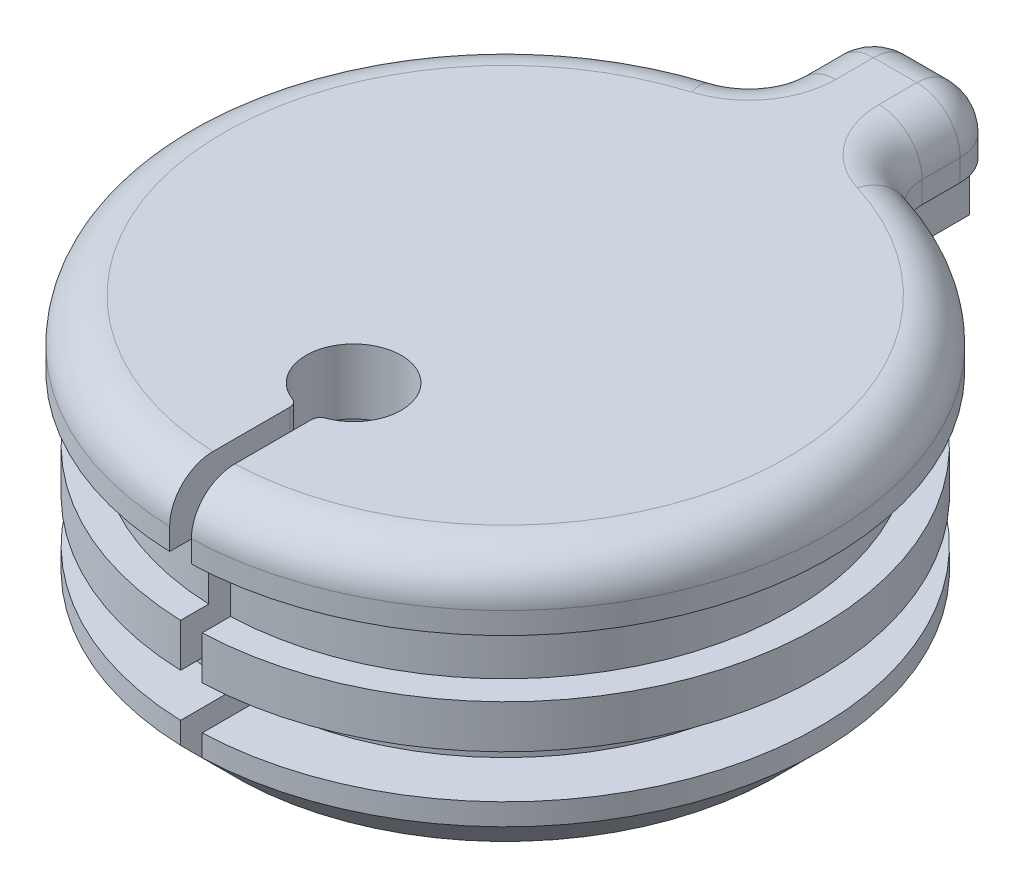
ISO-10303-21;
HEADER;
FILE_DESCRIPTION(('STEP AP214'),'2;1');
FILE_NAME('part.step','',(''),(''),'','','');
FILE_SCHEMA(('AUTOMOTIVE_DESIGN { 1 0 10303 214 1 1 1 1 }'));
ENDSEC;
DATA;
#1=APPLICATION_CONTEXT('core data for automotive mechanical design processes');
#2=APPLICATION_PROTOCOL_DEFINITION('international standard','automotive_design',2000,#1);
#3=PRODUCT_CONTEXT('',#1,'mechanical');
#4=PRODUCT('Part','Part','',(#3));
#5=PRODUCT_RELATED_PRODUCT_CATEGORY('part','',(#4));
#6=PRODUCT_DEFINITION_FORMATION('','',#4);
#7=PRODUCT_DEFINITION_CONTEXT('part definition',#1,'design');
#8=PRODUCT_DEFINITION('design','',#6,#7);
#9=PRODUCT_DEFINITION_SHAPE('','',#8);
#10=(LENGTH_UNIT() NAMED_UNIT(*) SI_UNIT(.MILLI.,.METRE.));
#11=(NAMED_UNIT(*) PLANE_ANGLE_UNIT() SI_UNIT($,.RADIAN.));
#12=(NAMED_UNIT(*) SI_UNIT($,.STERADIAN.) SOLID_ANGLE_UNIT());
#13=UNCERTAINTY_MEASURE_WITH_UNIT(LENGTH_MEASURE(1.E-05),#10,'distance_accuracy_value','');
#14=(GEOMETRIC_REPRESENTATION_CONTEXT(3) GLOBAL_UNCERTAINTY_ASSIGNED_CONTEXT((#13)) GLOBAL_UNIT_ASSIGNED_CONTEXT((#10,
#11,#12)) REPRESENTATION_CONTEXT('',''));
#15=CARTESIAN_POINT('',(0.,0.,0.));
#16=DIRECTION('',(0.,0.,1.));
#17=DIRECTION('',(1.,0.,0.));
#18=AXIS2_PLACEMENT_3D('',#15,#16,#17);
#19=CARTESIAN_POINT('',(0.,10.0962672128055,0.));
#20=DIRECTION('',(0.,1.,0.));
#21=DIRECTION('',(0.,0.,1.));
#22=AXIS2_PLACEMENT_3D('',#19,#20,#21);
#23=CYLINDRICAL_SURFACE('',#22,6.);
#24=DIRECTION('',(0.,1.,0.));
#25=VECTOR('',#24,1.);
#26=CARTESIAN_POINT('',(-0.250000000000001,10.0962672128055,5.9947894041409));
#27=LINE('',#26,#25);
#28=CARTESIAN_POINT('',(-0.25,-2.,5.9947894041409));
#29=VERTEX_POINT('',#28);
#30=CARTESIAN_POINT('',(-0.25,-1.,5.9947894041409));
#31=VERTEX_POINT('',#30);
#32=EDGE_CURVE('E343',#29,#31,#27,.T.);
#33=ORIENTED_EDGE('',*,*,#32,.T.);
#34=CARTESIAN_POINT('',(0.,-1.,0.));
#35=DIRECTION('',(0.,1.,0.));
#36=DIRECTION('',(0.,0.,1.));
#37=AXIS2_PLACEMENT_3D('',#34,#35,#36);
#38=CIRCLE('',#37,6.);
#39=CARTESIAN_POINT('',(0.250000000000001,-1.,5.9947894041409));
#40=VERTEX_POINT('',#39);
#41=EDGE_CURVE('E326',#40,#31,#38,.T.);
#42=ORIENTED_EDGE('',*,*,#41,.F.);
#43=DIRECTION('',(0.,1.,0.));
#44=VECTOR('',#43,1.);
#45=CARTESIAN_POINT('',(0.250000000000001,10.0962672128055,5.9947894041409));
#46=LINE('',#45,#44);
#47=CARTESIAN_POINT('',(0.250000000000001,-2.,5.9947894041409));
#48=VERTEX_POINT('',#47);
#49=EDGE_CURVE('E340',#40,#48,#46,.F.);
#50=ORIENTED_EDGE('',*,*,#49,.T.);
#51=CARTESIAN_POINT('',(0.,-2.,0.));
#52=DIRECTION('',(0.,1.,0.));
#53=DIRECTION('',(0.,0.,1.));
#54=AXIS2_PLACEMENT_3D('',#51,#52,#53);
#55=CIRCLE('',#54,6.);
#56=EDGE_CURVE('E314',#29,#48,#55,.F.);
#57=ORIENTED_EDGE('',*,*,#56,.F.);
#58=EDGE_LOOP('',(#33,#42,#50,#57));
#59=FACE_BOUND('',#58,.T.);
#60=ADVANCED_FACE('F17',(#59),#23,.T.);
#61=CARTESIAN_POINT('',(-0.499999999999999,3.,-9.));
#62=DIRECTION('',(0.,-1.,0.));
#63=DIRECTION('',(0.,0.,-1.));
#64=AXIS2_PLACEMENT_3D('',#61,#62,#63);
#65=CYLINDRICAL_SURFACE('',#64,1.);
#66=DIRECTION('',(0.,-1.,0.));
#67=VECTOR('',#66,1.);
#68=CARTESIAN_POINT('',(-0.749999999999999,3.,-9.96824583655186));
#69=LINE('',#68,#67);
#70=CARTESIAN_POINT('',(-0.749999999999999,0.,-9.96824583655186));
#71=VERTEX_POINT('',#70);
#72=CARTESIAN_POINT('',(-0.749999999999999,1.5,-9.96824583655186));
#73=VERTEX_POINT('',#72);
#74=EDGE_CURVE('E345',#71,#73,#69,.F.);
#75=ORIENTED_EDGE('',*,*,#74,.T.);
#76=CARTESIAN_POINT('',(-0.499999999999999,1.5,-9.));
#77=DIRECTION('',(0.,-1.,0.));
#78=DIRECTION('',(0.,0.,-1.));
#79=AXIS2_PLACEMENT_3D('',#76,#77,#78);
#80=CIRCLE('',#79,1.);
#81=CARTESIAN_POINT('',(-1.5,1.5,-9.));
#82=VERTEX_POINT('',#81);
#83=EDGE_CURVE('E330',#73,#82,#80,.F.);
#84=ORIENTED_EDGE('',*,*,#83,.T.);
#85=DIRECTION('',(0.,-1.,0.));
#86=VECTOR('',#85,1.);
#87=CARTESIAN_POINT('',(-1.5,3.,-9.));
#88=LINE('',#87,#86);
#89=CARTESIAN_POINT('',(-1.5,2.,-9.));
#90=VERTEX_POINT('',#89);
#91=EDGE_CURVE('E334',#82,#90,#88,.F.);
#92=ORIENTED_EDGE('',*,*,#91,.T.);
#93=CARTESIAN_POINT('',(-0.499999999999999,2.,-9.));
#94=DIRECTION('',(0.,-1.,0.));
#95=DIRECTION('',(0.,0.,-1.));
#96=AXIS2_PLACEMENT_3D('',#93,#94,#95);
#97=CIRCLE('',#96,1.);
#98=CARTESIAN_POINT('',(-0.499999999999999,2.,-10.));
#99=VERTEX_POINT('',#98);
#100=EDGE_CURVE('E331',#90,#99,#97,.T.);
#101=ORIENTED_EDGE('',*,*,#100,.T.);
#102=DIRECTION('',(0.,1.,0.));
#103=VECTOR('',#102,1.);
#104=CARTESIAN_POINT('',(-0.499999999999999,1.5,-10.));
#105=LINE('',#104,#103);
#106=CARTESIAN_POINT('',(-0.499999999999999,0.,-10.));
#107=VERTEX_POINT('',#106);
#108=EDGE_CURVE('E268',#99,#107,#105,.F.);
#109=ORIENTED_EDGE('',*,*,#108,.T.);
#110=CARTESIAN_POINT('',(-0.499999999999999,0.,-9.));
#111=DIRECTION('',(0.,-1.,0.));
#112=DIRECTION('',(0.,0.,-1.));
#113=AXIS2_PLACEMENT_3D('',#110,#111,#112);
#114=CIRCLE('',#113,1.);
#115=EDGE_CURVE('E211',#107,#71,#114,.F.);
#116=ORIENTED_EDGE('',*,*,#115,.T.);
#117=EDGE_LOOP('',(#75,#84,#92,#101,#109,#116));
#118=FACE_BOUND('',#117,.T.);
#119=ADVANCED_FACE('F778',(#118),#65,.T.);
#120=CARTESIAN_POINT('',(0.,-1.,7.25));
#121=DIRECTION('',(0.,-1.,0.));
#122=DIRECTION('',(0.,0.,-1.));
#123=AXIS2_PLACEMENT_3D('',#120,#121,#122);
#124=PLANE('',#123);
#125=DIRECTION('',(0.,0.,-1.));
#126=VECTOR('',#125,1.);
#127=CARTESIAN_POINT('',(-0.249999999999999,-1.,7.25));
#128=LINE('',#127,#126);
#129=CARTESIAN_POINT('',(-0.25,-1.,7.24568837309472));
#130=VERTEX_POINT('',#129);
#131=EDGE_CURVE('E324',#31,#130,#128,.F.);
#132=ORIENTED_EDGE('',*,*,#131,.T.);
#133=CARTESIAN_POINT('',(0.,-1.,0.));
#134=DIRECTION('',(0.,1.,0.));
#135=DIRECTION('',(0.,0.,1.));
#136=AXIS2_PLACEMENT_3D('',#133,#134,#135);
#137=CIRCLE('',#136,7.25);
#138=CARTESIAN_POINT('',(0.250000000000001,-1.,7.24568837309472));
#139=VERTEX_POINT('',#138);
#140=EDGE_CURVE('E307',#139,#130,#137,.T.);
#141=ORIENTED_EDGE('',*,*,#140,.F.);
#142=DIRECTION('',(0.,0.,-1.));
#143=VECTOR('',#142,1.);
#144=CARTESIAN_POINT('',(0.250000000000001,-1.,7.25));
#145=LINE('',#144,#143);
#146=EDGE_CURVE('E327',#139,#40,#145,.T.);
#147=ORIENTED_EDGE('',*,*,#146,.T.);
#148=ORIENTED_EDGE('',*,*,#41,.T.);
#149=EDGE_LOOP('',(#132,#141,#147,#148));
#150=FACE_BOUND('',#149,.T.);
#151=ADVANCED_FACE('F955',(#150),#124,.T.);
#152=CARTESIAN_POINT('',(0.,-2.,6.));
#153=DIRECTION('',(0.,1.,0.));
#154=DIRECTION('',(0.,0.,1.));
#155=AXIS2_PLACEMENT_3D('',#152,#153,#154);
#156=PLANE('',#155);
#157=DIRECTION('',(0.,0.,1.));
#158=VECTOR('',#157,1.);
#159=CARTESIAN_POINT('',(-0.249999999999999,-2.,6.));
#160=LINE('',#159,#158);
#161=CARTESIAN_POINT('',(-0.25,-2.,7.24568837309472));
#162=VERTEX_POINT('',#161);
#163=EDGE_CURVE('E318',#162,#29,#160,.F.);
#164=ORIENTED_EDGE('',*,*,#163,.T.);
#165=ORIENTED_EDGE('',*,*,#56,.T.);
#166=DIRECTION('',(0.,0.,1.));
#167=VECTOR('',#166,1.);
#168=CARTESIAN_POINT('',(0.250000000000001,-2.,6.));
#169=LINE('',#168,#167);
#170=CARTESIAN_POINT('',(0.250000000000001,-2.,7.24568837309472));
#171=VERTEX_POINT('',#170);
#172=EDGE_CURVE('E321',#48,#171,#169,.T.);
#173=ORIENTED_EDGE('',*,*,#172,.T.);
#174=CARTESIAN_POINT('',(0.,-2.,0.));
#175=DIRECTION('',(0.,1.,0.));
#176=DIRECTION('',(0.,0.,1.));
#177=AXIS2_PLACEMENT_3D('',#174,#175,#176);
#178=CIRCLE('',#177,7.25);
#179=EDGE_CURVE('E293',#162,#171,#178,.F.);
#180=ORIENTED_EDGE('',*,*,#179,.F.);
#181=EDGE_LOOP('',(#164,#165,#173,#180));
#182=FACE_BOUND('',#181,.T.);
#183=ADVANCED_FACE('F952',(#182),#156,.T.);
#184=CARTESIAN_POINT('',(-0.749999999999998,1.5,-10.));
#185=DIRECTION('',(0.,0.,1.));
#186=DIRECTION('',(1.,0.,0.));
#187=AXIS2_PLACEMENT_3D('',#184,#185,#186);
#188=PLANE('',#187);
#189=DIRECTION('',(1.,0.,0.));
#190=VECTOR('',#189,1.);
#191=CARTESIAN_POINT('',(-0.749999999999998,2.,-10.));
#192=LINE('',#191,#190);
#193=CARTESIAN_POINT('',(0.500000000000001,2.,-10.));
#194=VERTEX_POINT('',#193);
#195=EDGE_CURVE('E219',#194,#99,#192,.F.);
#196=ORIENTED_EDGE('',*,*,#195,.F.);
#197=DIRECTION('',(0.,-1.,0.));
#198=VECTOR('',#197,1.);
#199=CARTESIAN_POINT('',(0.500000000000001,1.5,-10.));
#200=LINE('',#199,#198);
#201=CARTESIAN_POINT('',(0.500000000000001,0.,-10.));
#202=VERTEX_POINT('',#201);
#203=EDGE_CURVE('E266',#202,#194,#200,.F.);
#204=ORIENTED_EDGE('',*,*,#203,.F.);
#205=DIRECTION('',(1.,0.,0.));
#206=VECTOR('',#205,1.);
#207=CARTESIAN_POINT('',(-0.749999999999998,0.,-10.));
#208=LINE('',#207,#206);
#209=EDGE_CURVE('E269',#107,#202,#208,.T.);
#210=ORIENTED_EDGE('',*,*,#209,.F.);
#211=ORIENTED_EDGE('',*,*,#108,.F.);
#212=EDGE_LOOP('',(#196,#204,#210,#211));
#213=FACE_BOUND('',#212,.T.);
#214=ADVANCED_FACE('F263',(#213),#188,.F.);
#215=CARTESIAN_POINT('',(0.,10.0962672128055,0.));
#216=DIRECTION('',(0.,1.,0.));
#217=DIRECTION('',(0.,0.,1.));
#218=AXIS2_PLACEMENT_3D('',#215,#216,#217);
#219=CYLINDRICAL_SURFACE('',#218,7.25);
#220=CARTESIAN_POINT('',(0.,0.,0.));
#221=DIRECTION('',(0.,1.,0.));
#222=DIRECTION('',(0.,0.,1.));
#223=AXIS2_PLACEMENT_3D('',#220,#221,#222);
#224=CIRCLE('',#223,7.25);
#225=CARTESIAN_POINT('',(-0.999710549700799,0.,-7.18074361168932));
#226=VERTEX_POINT('',#225);
#227=CARTESIAN_POINT('',(0.999710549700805,0.,-7.18074361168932));
#228=VERTEX_POINT('',#227);
#229=EDGE_CURVE('E747',#226,#228,#224,.F.);
#230=ORIENTED_EDGE('',*,*,#229,.T.);
#231=CARTESIAN_POINT('',(0.,0.,0.));
#232=DIRECTION('',(0.,1.,0.));
#233=DIRECTION('',(0.,0.,1.));
#234=AXIS2_PLACEMENT_3D('',#231,#232,#233);
#235=CIRCLE('',#234,7.25);
#236=CARTESIAN_POINT('',(0.250000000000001,0.,7.24568837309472));
#237=VERTEX_POINT('',#236);
#238=EDGE_CURVE('E752',#237,#228,#235,.T.);
#239=ORIENTED_EDGE('',*,*,#238,.F.);
#240=DIRECTION('',(0.,1.,0.));
#241=VECTOR('',#240,1.);
#242=CARTESIAN_POINT('',(0.250000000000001,10.0962672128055,7.24568837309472));
#243=LINE('',#242,#241);
#244=EDGE_CURVE('E304',#237,#139,#243,.F.);
#245=ORIENTED_EDGE('',*,*,#244,.T.);
#246=ORIENTED_EDGE('',*,*,#140,.T.);
#247=DIRECTION('',(0.,1.,0.));
#248=VECTOR('',#247,1.);
#249=CARTESIAN_POINT('',(-0.250000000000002,10.0962672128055,7.24568837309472));
#250=LINE('',#249,#248);
#251=CARTESIAN_POINT('',(-0.25,0.,7.24568837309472));
#252=VERTEX_POINT('',#251);
#253=EDGE_CURVE('E300',#130,#252,#250,.T.);
#254=ORIENTED_EDGE('',*,*,#253,.T.);
#255=CARTESIAN_POINT('',(0.,0.,0.));
#256=DIRECTION('',(0.,1.,0.));
#257=DIRECTION('',(0.,0.,1.));
#258=AXIS2_PLACEMENT_3D('',#255,#256,#257);
#259=CIRCLE('',#258,7.25);
#260=EDGE_CURVE('E746',#226,#252,#259,.T.);
#261=ORIENTED_EDGE('',*,*,#260,.F.);
#262=EDGE_LOOP('',(#230,#239,#245,#246,#254,#261));
#263=FACE_BOUND('',#262,.T.);
#264=ADVANCED_FACE('F947',(#263),#219,.T.);
#265=CARTESIAN_POINT('',(0.,10.0962672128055,0.));
#266=DIRECTION('',(0.,1.,0.));
#267=DIRECTION('',(0.,0.,1.));
#268=AXIS2_PLACEMENT_3D('',#265,#266,#267);
#269=CYLINDRICAL_SURFACE('',#268,7.25);
#270=DIRECTION('',(0.,1.,0.));
#271=VECTOR('',#270,1.);
#272=CARTESIAN_POINT('',(-0.250000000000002,10.0962672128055,7.24568837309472));
#273=LINE('',#272,#271);
#274=CARTESIAN_POINT('',(-0.25,-2.5,7.24568837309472));
#275=VERTEX_POINT('',#274);
#276=EDGE_CURVE('E296',#275,#162,#273,.T.);
#277=ORIENTED_EDGE('',*,*,#276,.T.);
#278=ORIENTED_EDGE('',*,*,#179,.T.);
#279=DIRECTION('',(0.,1.,0.));
#280=VECTOR('',#279,1.);
#281=CARTESIAN_POINT('',(0.250000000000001,10.0962672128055,7.24568837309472));
#282=LINE('',#281,#280);
#283=CARTESIAN_POINT('',(0.250000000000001,-2.5,7.24568837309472));
#284=VERTEX_POINT('',#283);
#285=EDGE_CURVE('E758',#171,#284,#282,.F.);
#286=ORIENTED_EDGE('',*,*,#285,.T.);
#287=CARTESIAN_POINT('',(0.,-2.5,0.));
#288=DIRECTION('',(0.,1.,0.));
#289=DIRECTION('',(0.,0.,1.));
#290=AXIS2_PLACEMENT_3D('',#287,#288,#289);
#291=CIRCLE('',#290,7.25);
#292=EDGE_CURVE('E743',#275,#284,#291,.F.);
#293=ORIENTED_EDGE('',*,*,#292,.F.);
#294=EDGE_LOOP('',(#277,#278,#286,#293));
#295=FACE_BOUND('',#294,.T.);
#296=ADVANCED_FACE('F944',(#295),#269,.T.);
#297=CARTESIAN_POINT('',(0.500000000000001,1.5,-9.));
#298=DIRECTION('',(0.,-1.,0.));
#299=DIRECTION('',(0.,0.,-1.));
#300=AXIS2_PLACEMENT_3D('',#297,#298,#299);
#301=CYLINDRICAL_SURFACE('',#300,1.);
#302=DIRECTION('',(0.,1.,0.));
#303=VECTOR('',#302,1.);
#304=CARTESIAN_POINT('',(0.750000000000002,1.5,-9.96824583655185));
#305=LINE('',#304,#303);
#306=CARTESIAN_POINT('',(0.750000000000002,1.5,-9.96824583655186));
#307=VERTEX_POINT('',#306);
#308=CARTESIAN_POINT('',(0.750000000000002,0.,-9.96824583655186));
#309=VERTEX_POINT('',#308);
#310=EDGE_CURVE('E741',#307,#309,#305,.F.);
#311=ORIENTED_EDGE('',*,*,#310,.T.);
#312=CARTESIAN_POINT('',(0.500000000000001,0.,-9.));
#313=DIRECTION('',(0.,-1.,0.));
#314=DIRECTION('',(0.,0.,-1.));
#315=AXIS2_PLACEMENT_3D('',#312,#313,#314);
#316=CIRCLE('',#315,1.);
#317=EDGE_CURVE('E292',#309,#202,#316,.F.);
#318=ORIENTED_EDGE('',*,*,#317,.T.);
#319=ORIENTED_EDGE('',*,*,#203,.T.);
#320=CARTESIAN_POINT('',(0.500000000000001,2.,-9.));
#321=DIRECTION('',(0.,-1.,0.));
#322=DIRECTION('',(0.,0.,-1.));
#323=AXIS2_PLACEMENT_3D('',#320,#321,#322);
#324=CIRCLE('',#323,1.);
#325=CARTESIAN_POINT('',(1.5,2.,-9.));
#326=VERTEX_POINT('',#325);
#327=EDGE_CURVE('E275',#194,#326,#324,.T.);
#328=ORIENTED_EDGE('',*,*,#327,.T.);
#329=DIRECTION('',(0.,-1.,0.));
#330=VECTOR('',#329,1.);
#331=CARTESIAN_POINT('',(1.5,1.5,-9.));
#332=LINE('',#331,#330);
#333=CARTESIAN_POINT('',(1.5,1.5,-9.));
#334=VERTEX_POINT('',#333);
#335=EDGE_CURVE('E257',#326,#334,#332,.T.);
#336=ORIENTED_EDGE('',*,*,#335,.T.);
#337=CARTESIAN_POINT('',(0.500000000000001,1.5,-9.));
#338=DIRECTION('',(0.,-1.,0.));
#339=DIRECTION('',(0.,0.,-1.));
#340=AXIS2_PLACEMENT_3D('',#337,#338,#339);
#341=CIRCLE('',#340,1.);
#342=EDGE_CURVE('E309',#334,#307,#341,.F.);
#343=ORIENTED_EDGE('',*,*,#342,.T.);
#344=EDGE_LOOP('',(#311,#318,#319,#328,#336,#343));
#345=FACE_BOUND('',#344,.T.);
#346=ADVANCED_FACE('F290',(#345),#301,.T.);
#347=CARTESIAN_POINT('',(0.,0.,0.));
#348=DIRECTION('',(0.,1.,0.));
#349=DIRECTION('',(0.,0.,1.));
#350=AXIS2_PLACEMENT_3D('',#347,#348,#349);
#351=PLANE('',#350);
#352=CARTESIAN_POINT('',(2.75,0.,-8.14846611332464));
#353=DIRECTION('',(0.,-1.,0.));
#354=DIRECTION('',(0.,0.,-1.));
#355=AXIS2_PLACEMENT_3D('',#352,#353,#354);
#356=CIRCLE('',#355,2.);
#357=CARTESIAN_POINT('',(2.11046511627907,0.,-6.25347399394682));
#358=VERTEX_POINT('',#357);
#359=EDGE_CURVE('E735',#228,#358,#356,.F.);
#360=ORIENTED_EDGE('',*,*,#359,.T.);
#361=CARTESIAN_POINT('',(0.,0.,0.));
#362=DIRECTION('',(0.,-1.,0.));
#363=DIRECTION('',(0.,0.,-1.));
#364=AXIS2_PLACEMENT_3D('',#361,#362,#363);
#365=CIRCLE('',#364,6.6);
#366=CARTESIAN_POINT('',(0.250000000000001,0.,6.59526345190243));
#367=VERTEX_POINT('',#366);
#368=EDGE_CURVE('E731',#367,#358,#365,.F.);
#369=ORIENTED_EDGE('',*,*,#368,.F.);
#370=DIRECTION('',(0.,0.,1.));
#371=VECTOR('',#370,1.);
#372=CARTESIAN_POINT('',(0.250000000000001,0.,0.));
#373=LINE('',#372,#371);
#374=EDGE_CURVE('E749',#367,#237,#373,.T.);
#375=ORIENTED_EDGE('',*,*,#374,.T.);
#376=ORIENTED_EDGE('',*,*,#238,.T.);
#377=EDGE_LOOP('',(#360,#369,#375,#376));
#378=FACE_BOUND('',#377,.T.);
#379=ADVANCED_FACE('F938',(#378),#351,.T.);
#380=CARTESIAN_POINT('',(0.,0.,0.));
#381=DIRECTION('',(0.,1.,0.));
#382=DIRECTION('',(0.,0.,1.));
#383=AXIS2_PLACEMENT_3D('',#380,#381,#382);
#384=PLANE('',#383);
#385=ORIENTED_EDGE('',*,*,#229,.F.);
#386=CARTESIAN_POINT('',(-2.75,0.,-8.14846611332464));
#387=DIRECTION('',(0.,-1.,0.));
#388=DIRECTION('',(0.,0.,-1.));
#389=AXIS2_PLACEMENT_3D('',#386,#387,#388);
#390=CIRCLE('',#389,2.);
#391=CARTESIAN_POINT('',(-0.749999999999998,0.,-8.14846611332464));
#392=VERTEX_POINT('',#391);
#393=EDGE_CURVE('E726',#226,#392,#390,.F.);
#394=ORIENTED_EDGE('',*,*,#393,.T.);
#395=DIRECTION('',(0.,0.,-1.));
#396=VECTOR('',#395,1.);
#397=CARTESIAN_POINT('',(-0.749999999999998,0.,-10.));
#398=LINE('',#397,#396);
#399=EDGE_CURVE('E725',#392,#71,#398,.T.);
#400=ORIENTED_EDGE('',*,*,#399,.T.);
#401=ORIENTED_EDGE('',*,*,#115,.F.);
#402=ORIENTED_EDGE('',*,*,#209,.T.);
#403=ORIENTED_EDGE('',*,*,#317,.F.);
#404=DIRECTION('',(0.,0.,1.));
#405=VECTOR('',#404,1.);
#406=CARTESIAN_POINT('',(0.750000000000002,0.,-10.));
#407=LINE('',#406,#405);
#408=CARTESIAN_POINT('',(0.750000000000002,0.,-8.14846611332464));
#409=VERTEX_POINT('',#408);
#410=EDGE_CURVE('E740',#309,#409,#407,.T.);
#411=ORIENTED_EDGE('',*,*,#410,.T.);
#412=CARTESIAN_POINT('',(2.75,0.,-8.14846611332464));
#413=DIRECTION('',(0.,-1.,0.));
#414=DIRECTION('',(0.,0.,-1.));
#415=AXIS2_PLACEMENT_3D('',#412,#413,#414);
#416=CIRCLE('',#415,2.);
#417=EDGE_CURVE('E739',#409,#228,#416,.F.);
#418=ORIENTED_EDGE('',*,*,#417,.T.);
#419=EDGE_LOOP('',(#385,#394,#400,#401,#402,#403,#411,#418));
#420=FACE_BOUND('',#419,.T.);
#421=ADVANCED_FACE('F786',(#420),#384,.F.);
#422=CARTESIAN_POINT('',(0.,0.,0.));
#423=DIRECTION('',(0.,1.,0.));
#424=DIRECTION('',(0.,0.,1.));
#425=AXIS2_PLACEMENT_3D('',#422,#423,#424);
#426=PLANE('',#425);
#427=CARTESIAN_POINT('',(-2.75,0.,-8.14846611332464));
#428=DIRECTION('',(0.,-1.,0.));
#429=DIRECTION('',(0.,0.,-1.));
#430=AXIS2_PLACEMENT_3D('',#427,#428,#429);
#431=CIRCLE('',#430,2.);
#432=CARTESIAN_POINT('',(-2.11046511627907,0.,-6.25347399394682));
#433=VERTEX_POINT('',#432);
#434=EDGE_CURVE('E730',#433,#226,#431,.F.);
#435=ORIENTED_EDGE('',*,*,#434,.T.);
#436=ORIENTED_EDGE('',*,*,#260,.T.);
#437=DIRECTION('',(0.,0.,1.));
#438=VECTOR('',#437,1.);
#439=CARTESIAN_POINT('',(-0.249999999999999,0.,0.));
#440=LINE('',#439,#438);
#441=CARTESIAN_POINT('',(-0.249999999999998,0.,6.59526345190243));
#442=VERTEX_POINT('',#441);
#443=EDGE_CURVE('E744',#252,#442,#440,.F.);
#444=ORIENTED_EDGE('',*,*,#443,.T.);
#445=CARTESIAN_POINT('',(0.,0.,0.));
#446=DIRECTION('',(0.,-1.,0.));
#447=DIRECTION('',(0.,0.,-1.));
#448=AXIS2_PLACEMENT_3D('',#445,#446,#447);
#449=CIRCLE('',#448,6.6);
#450=EDGE_CURVE('E719',#433,#442,#449,.F.);
#451=ORIENTED_EDGE('',*,*,#450,.F.);
#452=EDGE_LOOP('',(#435,#436,#444,#451));
#453=FACE_BOUND('',#452,.T.);
#454=ADVANCED_FACE('F929',(#453),#426,.T.);
#455=CARTESIAN_POINT('',(0.,-2.5,0.));
#456=DIRECTION('',(0.,1.,0.));
#457=DIRECTION('',(0.,0.,1.));
#458=AXIS2_PLACEMENT_3D('',#455,#456,#457);
#459=CONICAL_SURFACE('',#458,7.25,0.785398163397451);
#460=CARTESIAN_POINT('',(-0.249999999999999,-3.5,6.24499799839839));
#461=CARTESIAN_POINT('',(-0.249999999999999,-3.33334186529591,6.41178825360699));
#462=CARTESIAN_POINT('',(-0.249999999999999,-3.1666794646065,6.57857424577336));
#463=CARTESIAN_POINT('',(-0.249999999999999,-2.83334613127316,6.91213770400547));
#464=CARTESIAN_POINT('',(-0.249999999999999,-2.66667519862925,7.07891517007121));
#465=CARTESIAN_POINT('',(-0.249999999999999,-2.5,7.24568837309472));
#466=B_SPLINE_CURVE_WITH_KNOTS('',3,(#460,#461,#462,#463,#464,#465),.UNSPECIFIED.,.F.,.F.,(4,2,
4),(0.,0.707350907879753,1.41470181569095),.UNSPECIFIED.);
#467=CARTESIAN_POINT('',(-0.249999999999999,-3.5,6.2449979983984));
#468=VERTEX_POINT('',#467);
#469=EDGE_CURVE('E756',#468,#275,#466,.T.);
#470=ORIENTED_EDGE('',*,*,#469,.T.);
#471=ORIENTED_EDGE('',*,*,#292,.T.);
#472=CARTESIAN_POINT('',(0.250000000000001,-2.5,7.24568837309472));
#473=CARTESIAN_POINT('',(0.250000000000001,-2.66667519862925,7.07891517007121));
#474=CARTESIAN_POINT('',(0.250000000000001,-2.83334613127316,6.91213770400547));
#475=CARTESIAN_POINT('',(0.250000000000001,-3.1666794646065,6.57857424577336));
#476=CARTESIAN_POINT('',(0.250000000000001,-3.33334186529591,6.41178825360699));
#477=CARTESIAN_POINT('',(0.250000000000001,-3.5,6.2449979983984));
#478=B_SPLINE_CURVE_WITH_KNOTS('',3,(#472,#473,#474,#475,#476,#477),.UNSPECIFIED.,.F.,.F.,(4,2,
4),(0.,0.707350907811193,1.41470181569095),.UNSPECIFIED.);
#479=CARTESIAN_POINT('',(0.250000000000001,-3.5,6.2449979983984));
#480=VERTEX_POINT('',#479);
#481=EDGE_CURVE('E913',#284,#480,#478,.T.);
#482=ORIENTED_EDGE('',*,*,#481,.T.);
#483=CARTESIAN_POINT('',(0.,-3.5,0.));
#484=DIRECTION('',(0.,1.,0.));
#485=DIRECTION('',(0.,0.,1.));
#486=AXIS2_PLACEMENT_3D('',#483,#484,#485);
#487=CIRCLE('',#486,6.25);
#488=EDGE_CURVE('E635',#468,#480,#487,.F.);
#489=ORIENTED_EDGE('',*,*,#488,.F.);
#490=EDGE_LOOP('',(#470,#471,#482,#489));
#491=FACE_BOUND('',#490,.T.);
#492=ADVANCED_FACE('F923',(#491),#459,.T.);
#493=CARTESIAN_POINT('',(0.750000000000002,1.5,-10.));
#494=DIRECTION('',(-1.,0.,0.));
#495=DIRECTION('',(0.,0.,1.));
#496=AXIS2_PLACEMENT_3D('',#493,#494,#495);
#497=PLANE('',#496);
#498=ORIENTED_EDGE('',*,*,#310,.F.);
#499=DIRECTION('',(0.,0.,1.));
#500=VECTOR('',#499,1.);
#501=CARTESIAN_POINT('',(0.750000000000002,1.5,0.));
#502=LINE('',#501,#500);
#503=CARTESIAN_POINT('',(0.750000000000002,1.5,-8.14846611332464));
#504=VERTEX_POINT('',#503);
#505=EDGE_CURVE('E610',#307,#504,#502,.T.);
#506=ORIENTED_EDGE('',*,*,#505,.T.);
#507=DIRECTION('',(0.,-1.,0.));
#508=VECTOR('',#507,1.);
#509=CARTESIAN_POINT('',(0.750000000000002,1.5,-8.14846611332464));
#510=LINE('',#509,#508);
#511=EDGE_CURVE('E736',#504,#409,#510,.T.);
#512=ORIENTED_EDGE('',*,*,#511,.T.);
#513=ORIENTED_EDGE('',*,*,#410,.F.);
#514=EDGE_LOOP('',(#498,#506,#512,#513));
#515=FACE_BOUND('',#514,.T.);
#516=ADVANCED_FACE('F928',(#515),#497,.F.);
#517=CARTESIAN_POINT('',(2.75,1.5,-8.14846611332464));
#518=DIRECTION('',(0.,-1.,0.));
#519=DIRECTION('',(0.,0.,-1.));
#520=AXIS2_PLACEMENT_3D('',#517,#518,#519);
#521=CYLINDRICAL_SURFACE('',#520,2.);
#522=DIRECTION('',(0.,-1.,0.));
#523=VECTOR('',#522,1.);
#524=CARTESIAN_POINT('',(2.11046511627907,1.5,-6.25347399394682));
#525=LINE('',#524,#523);
#526=CARTESIAN_POINT('',(2.11046511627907,1.5,-6.25347399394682));
#527=VERTEX_POINT('',#526);
#528=EDGE_CURVE('E727',#358,#527,#525,.F.);
#529=ORIENTED_EDGE('',*,*,#528,.F.);
#530=ORIENTED_EDGE('',*,*,#359,.F.);
#531=ORIENTED_EDGE('',*,*,#417,.F.);
#532=ORIENTED_EDGE('',*,*,#511,.F.);
#533=CARTESIAN_POINT('',(2.75,1.5,-8.14846611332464));
#534=DIRECTION('',(0.,-1.,0.));
#535=DIRECTION('',(0.,0.,-1.));
#536=AXIS2_PLACEMENT_3D('',#533,#534,#535);
#537=CIRCLE('',#536,2.);
#538=EDGE_CURVE('E612',#504,#527,#537,.F.);
#539=ORIENTED_EDGE('',*,*,#538,.T.);
#540=EDGE_LOOP('',(#529,#530,#531,#532,#539));
#541=FACE_BOUND('',#540,.T.);
#542=ADVANCED_FACE('F1011',(#541),#521,.F.);
#543=CARTESIAN_POINT('',(0.,1.5,0.));
#544=DIRECTION('',(0.,-1.,0.));
#545=DIRECTION('',(0.,0.,-1.));
#546=AXIS2_PLACEMENT_3D('',#543,#544,#545);
#547=CYLINDRICAL_SURFACE('',#546,6.6);
#548=ORIENTED_EDGE('',*,*,#368,.T.);
#549=ORIENTED_EDGE('',*,*,#528,.T.);
#550=CARTESIAN_POINT('',(0.,1.5,0.));
#551=DIRECTION('',(0.,-1.,0.));
#552=DIRECTION('',(0.,0.,-1.));
#553=AXIS2_PLACEMENT_3D('',#550,#551,#552);
#554=CIRCLE('',#553,6.6);
#555=CARTESIAN_POINT('',(0.250000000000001,1.5,6.59526345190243));
#556=VERTEX_POINT('',#555);
#557=EDGE_CURVE('E609',#527,#556,#554,.T.);
#558=ORIENTED_EDGE('',*,*,#557,.T.);
#559=DIRECTION('',(0.,-1.,0.));
#560=VECTOR('',#559,1.);
#561=CARTESIAN_POINT('',(0.250000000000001,1.5,6.59526345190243));
#562=LINE('',#561,#560);
#563=EDGE_CURVE('E732',#556,#367,#562,.T.);
#564=ORIENTED_EDGE('',*,*,#563,.T.);
#565=EDGE_LOOP('',(#548,#549,#558,#564));
#566=FACE_BOUND('',#565,.T.);
#567=ADVANCED_FACE('F977',(#566),#547,.T.);
#568=CARTESIAN_POINT('',(-2.75,1.5,-8.14846611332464));
#569=DIRECTION('',(0.,-1.,0.));
#570=DIRECTION('',(0.,0.,-1.));
#571=AXIS2_PLACEMENT_3D('',#568,#569,#570);
#572=CYLINDRICAL_SURFACE('',#571,2.);
#573=DIRECTION('',(0.,1.,0.));
#574=VECTOR('',#573,1.);
#575=CARTESIAN_POINT('',(-0.749999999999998,1.5,-8.14846611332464));
#576=LINE('',#575,#574);
#577=CARTESIAN_POINT('',(-0.749999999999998,1.5,-8.14846611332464));
#578=VERTEX_POINT('',#577);
#579=EDGE_CURVE('E722',#578,#392,#576,.F.);
#580=ORIENTED_EDGE('',*,*,#579,.T.);
#581=ORIENTED_EDGE('',*,*,#393,.F.);
#582=ORIENTED_EDGE('',*,*,#434,.F.);
#583=DIRECTION('',(0.,-1.,0.));
#584=VECTOR('',#583,1.);
#585=CARTESIAN_POINT('',(-2.11046511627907,1.5,-6.25347399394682));
#586=LINE('',#585,#584);
#587=CARTESIAN_POINT('',(-2.11046511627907,1.5,-6.25347399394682));
#588=VERTEX_POINT('',#587);
#589=EDGE_CURVE('E697',#588,#433,#586,.T.);
#590=ORIENTED_EDGE('',*,*,#589,.F.);
#591=CARTESIAN_POINT('',(-2.75,1.5,-8.14846611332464));
#592=DIRECTION('',(0.,-1.,0.));
#593=DIRECTION('',(0.,0.,-1.));
#594=AXIS2_PLACEMENT_3D('',#591,#592,#593);
#595=CIRCLE('',#594,2.);
#596=EDGE_CURVE('E602',#588,#578,#595,.F.);
#597=ORIENTED_EDGE('',*,*,#596,.T.);
#598=EDGE_LOOP('',(#580,#581,#582,#590,#597));
#599=FACE_BOUND('',#598,.T.);
#600=ADVANCED_FACE('F792',(#599),#572,.F.);
#601=CARTESIAN_POINT('',(-0.749999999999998,1.5,-10.));
#602=DIRECTION('',(1.,0.,0.));
#603=DIRECTION('',(0.,0.,-1.));
#604=AXIS2_PLACEMENT_3D('',#601,#602,#603);
#605=PLANE('',#604);
#606=ORIENTED_EDGE('',*,*,#74,.F.);
#607=ORIENTED_EDGE('',*,*,#399,.F.);
#608=ORIENTED_EDGE('',*,*,#579,.F.);
#609=DIRECTION('',(0.,0.,1.));
#610=VECTOR('',#609,1.);
#611=CARTESIAN_POINT('',(-0.749999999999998,1.5,0.));
#612=LINE('',#611,#610);
#613=EDGE_CURVE('E599',#578,#73,#612,.F.);
#614=ORIENTED_EDGE('',*,*,#613,.T.);
#615=EDGE_LOOP('',(#606,#607,#608,#614));
#616=FACE_BOUND('',#615,.T.);
#617=ADVANCED_FACE('F782',(#616),#605,.F.);
#618=CARTESIAN_POINT('',(0.,1.5,0.));
#619=DIRECTION('',(0.,-1.,0.));
#620=DIRECTION('',(0.,0.,-1.));
#621=AXIS2_PLACEMENT_3D('',#618,#619,#620);
#622=CYLINDRICAL_SURFACE('',#621,6.6);
#623=CARTESIAN_POINT('',(0.,1.5,0.));
#624=DIRECTION('',(0.,-1.,0.));
#625=DIRECTION('',(0.,0.,-1.));
#626=AXIS2_PLACEMENT_3D('',#623,#624,#625);
#627=CIRCLE('',#626,6.6);
#628=CARTESIAN_POINT('',(-0.249999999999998,1.5,6.59526345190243));
#629=VERTEX_POINT('',#628);
#630=EDGE_CURVE('E598',#629,#588,#627,.T.);
#631=ORIENTED_EDGE('',*,*,#630,.T.);
#632=ORIENTED_EDGE('',*,*,#589,.T.);
#633=ORIENTED_EDGE('',*,*,#450,.T.);
#634=DIRECTION('',(0.,-1.,0.));
#635=VECTOR('',#634,1.);
#636=CARTESIAN_POINT('',(-0.249999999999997,1.5,6.59526345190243));
#637=LINE('',#636,#635);
#638=EDGE_CURVE('E711',#442,#629,#637,.F.);
#639=ORIENTED_EDGE('',*,*,#638,.T.);
#640=EDGE_LOOP('',(#631,#632,#633,#639));
#641=FACE_BOUND('',#640,.T.);
#642=ADVANCED_FACE('F1003',(#641),#622,.T.);
#643=CARTESIAN_POINT('',(0.,-3.5,7.25));
#644=DIRECTION('',(0.,-1.,0.));
#645=DIRECTION('',(0.,0.,-1.));
#646=AXIS2_PLACEMENT_3D('',#643,#644,#645);
#647=PLANE('',#646);
#648=DIRECTION('',(0.,0.,-1.));
#649=VECTOR('',#648,1.);
#650=CARTESIAN_POINT('',(-0.249999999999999,-3.5,7.25));
#651=LINE('',#650,#649);
#652=CARTESIAN_POINT('',(-0.249999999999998,-3.5,5.49431524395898));
#653=VERTEX_POINT('',#652);
#654=EDGE_CURVE('E690',#653,#468,#651,.F.);
#655=ORIENTED_EDGE('',*,*,#654,.T.);
#656=ORIENTED_EDGE('',*,*,#488,.T.);
#657=DIRECTION('',(0.,0.,-1.));
#658=VECTOR('',#657,1.);
#659=CARTESIAN_POINT('',(0.250000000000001,-3.5,7.25));
#660=LINE('',#659,#658);
#661=CARTESIAN_POINT('',(0.250000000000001,-3.5,5.49431524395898));
#662=VERTEX_POINT('',#661);
#663=EDGE_CURVE('E694',#480,#662,#660,.T.);
#664=ORIENTED_EDGE('',*,*,#663,.T.);
#665=CARTESIAN_POINT('',(0.,-3.5,0.));
#666=DIRECTION('',(0.,-1.,0.));
#667=DIRECTION('',(0.,0.,-1.));
#668=AXIS2_PLACEMENT_3D('',#665,#666,#667);
#669=CIRCLE('',#668,5.5);
#670=CARTESIAN_POINT('',(0.,-3.5,-5.5));
#671=VERTEX_POINT('',#670);
#672=EDGE_CURVE('E684',#671,#662,#669,.T.);
#673=ORIENTED_EDGE('',*,*,#672,.F.);
#674=CARTESIAN_POINT('',(0.,-3.5,0.));
#675=DIRECTION('',(0.,-1.,0.));
#676=DIRECTION('',(-0.0454545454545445,0.,0.998966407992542));
#677=AXIS2_PLACEMENT_3D('',#674,#675,#676);
#678=CIRCLE('',#677,5.5);
#679=EDGE_CURVE('E671',#653,#671,#678,.T.);
#680=ORIENTED_EDGE('',*,*,#679,.F.);
#681=EDGE_LOOP('',(#655,#656,#664,#673,#680));
#682=FACE_BOUND('',#681,.T.);
#683=ADVANCED_FACE('F623',(#682),#647,.T.);
#684=CARTESIAN_POINT('',(0.,1.5,0.));
#685=DIRECTION('',(0.,1.,0.));
#686=DIRECTION('',(0.,0.,1.));
#687=AXIS2_PLACEMENT_3D('',#684,#685,#686);
#688=PLANE('',#687);
#689=DIRECTION('',(0.,0.,1.));
#690=VECTOR('',#689,1.);
#691=CARTESIAN_POINT('',(0.250000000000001,1.5,0.));
#692=LINE('',#691,#690);
#693=CARTESIAN_POINT('',(0.250000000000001,1.5,7.49583217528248));
#694=VERTEX_POINT('',#693);
#695=EDGE_CURVE('E607',#556,#694,#692,.T.);
#696=ORIENTED_EDGE('',*,*,#695,.F.);
#697=ORIENTED_EDGE('',*,*,#557,.F.);
#698=ORIENTED_EDGE('',*,*,#538,.F.);
#699=ORIENTED_EDGE('',*,*,#505,.F.);
#700=ORIENTED_EDGE('',*,*,#342,.F.);
#701=DIRECTION('',(0.,0.,1.));
#702=VECTOR('',#701,1.);
#703=CARTESIAN_POINT('',(1.5,1.5,0.));
#704=LINE('',#703,#702);
#705=CARTESIAN_POINT('',(1.5,1.5,-8.12403840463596));
#706=VERTEX_POINT('',#705);
#707=EDGE_CURVE('E613',#706,#334,#704,.F.);
#708=ORIENTED_EDGE('',*,*,#707,.F.);
#709=CARTESIAN_POINT('',(2.5,1.5,-8.12403840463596));
#710=DIRECTION('',(0.,-1.,0.));
#711=DIRECTION('',(0.,0.,-1.));
#712=AXIS2_PLACEMENT_3D('',#709,#710,#711);
#713=CIRCLE('',#712,1.);
#714=CARTESIAN_POINT('',(2.20588235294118,1.5,-7.16826918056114));
#715=VERTEX_POINT('',#714);
#716=EDGE_CURVE('E615',#715,#706,#713,.T.);
#717=ORIENTED_EDGE('',*,*,#716,.F.);
#718=CARTESIAN_POINT('',(0.,1.5,0.));
#719=DIRECTION('',(0.,-1.,0.));
#720=DIRECTION('',(0.,0.,-1.));
#721=AXIS2_PLACEMENT_3D('',#718,#719,#720);
#722=CIRCLE('',#721,7.5);
#723=EDGE_CURVE('E660',#694,#715,#722,.F.);
#724=ORIENTED_EDGE('',*,*,#723,.F.);
#725=EDGE_LOOP('',(#696,#697,#698,#699,#700,#708,#717,#724));
#726=FACE_BOUND('',#725,.T.);
#727=ADVANCED_FACE('F622',(#726),#688,.F.);
#728=CARTESIAN_POINT('',(0.,1.5,0.));
#729=DIRECTION('',(0.,1.,0.));
#730=DIRECTION('',(0.,0.,1.));
#731=AXIS2_PLACEMENT_3D('',#728,#729,#730);
#732=PLANE('',#731);
#733=DIRECTION('',(0.,0.,1.));
#734=VECTOR('',#733,1.);
#735=CARTESIAN_POINT('',(-0.249999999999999,1.5,0.));
#736=LINE('',#735,#734);
#737=CARTESIAN_POINT('',(-0.249999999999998,1.5,7.49583217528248));
#738=VERTEX_POINT('',#737);
#739=EDGE_CURVE('E596',#738,#629,#736,.F.);
#740=ORIENTED_EDGE('',*,*,#739,.F.);
#741=CARTESIAN_POINT('',(0.,1.5,0.));
#742=DIRECTION('',(0.,-1.,0.));
#743=DIRECTION('',(0.,0.,-1.));
#744=AXIS2_PLACEMENT_3D('',#741,#742,#743);
#745=CIRCLE('',#744,7.5);
#746=CARTESIAN_POINT('',(-2.20588235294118,1.5,-7.16826918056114));
#747=VERTEX_POINT('',#746);
#748=EDGE_CURVE('E525',#747,#738,#745,.F.);
#749=ORIENTED_EDGE('',*,*,#748,.F.);
#750=CARTESIAN_POINT('',(-2.5,1.5,-8.12403840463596));
#751=DIRECTION('',(0.,-1.,0.));
#752=DIRECTION('',(0.,0.,-1.));
#753=AXIS2_PLACEMENT_3D('',#750,#751,#752);
#754=CIRCLE('',#753,0.999999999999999);
#755=CARTESIAN_POINT('',(-1.5,1.5,-8.12403840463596));
#756=VERTEX_POINT('',#755);
#757=EDGE_CURVE('E542',#747,#756,#754,.F.);
#758=ORIENTED_EDGE('',*,*,#757,.T.);
#759=DIRECTION('',(0.,0.,-1.));
#760=VECTOR('',#759,1.);
#761=CARTESIAN_POINT('',(-1.5,1.5,-10.));
#762=LINE('',#761,#760);
#763=EDGE_CURVE('E603',#756,#82,#762,.T.);
#764=ORIENTED_EDGE('',*,*,#763,.T.);
#765=ORIENTED_EDGE('',*,*,#83,.F.);
#766=ORIENTED_EDGE('',*,*,#613,.F.);
#767=ORIENTED_EDGE('',*,*,#596,.F.);
#768=ORIENTED_EDGE('',*,*,#630,.F.);
#769=EDGE_LOOP('',(#740,#749,#758,#764,#765,#766,#767,#768));
#770=FACE_BOUND('',#769,.T.);
#771=ADVANCED_FACE('F585',(#770),#732,.F.);
#772=CARTESIAN_POINT('',(0.,-3.,0.));
#773=DIRECTION('',(0.,-1.,0.));
#774=DIRECTION('',(0.,0.,-1.));
#775=AXIS2_PLACEMENT_3D('',#772,#773,#774);
#776=TOROIDAL_SURFACE('',#775,5.5,0.5);
#777=CARTESIAN_POINT('',(0.,-3.,0.));
#778=DIRECTION('',(0.,-1.,0.));
#779=DIRECTION('',(0.,0.,-1.));
#780=AXIS2_PLACEMENT_3D('',#777,#778,#779);
#781=CIRCLE('',#780,5.);
#782=CARTESIAN_POINT('',(0.250000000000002,-3.,4.99374608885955));
#783=VERTEX_POINT('',#782);
#784=CARTESIAN_POINT('',(-0.249999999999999,-3.,4.99374608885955));
#785=VERTEX_POINT('',#784);
#786=EDGE_CURVE('E521',#783,#785,#781,.F.);
#787=ORIENTED_EDGE('',*,*,#786,.T.);
#788=CARTESIAN_POINT('',(-0.249999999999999,-3.,4.99374608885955));
#789=CARTESIAN_POINT('',(-0.24999999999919,-3.02810441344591,4.99372203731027));
#790=CARTESIAN_POINT('',(-0.249999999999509,-3.05620146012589,4.99611718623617));
#791=CARTESIAN_POINT('',(-0.250000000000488,-3.11157778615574,5.00556812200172));
#792=CARTESIAN_POINT('',(-0.250000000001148,-3.13885771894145,5.01262007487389));
#793=CARTESIAN_POINT('',(-0.250000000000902,-3.19185794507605,5.03121173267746));
#794=CARTESIAN_POINT('',(-0.249999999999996,-3.21757750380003,5.04275353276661));
#795=CARTESIAN_POINT('',(-0.250000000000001,-3.26671153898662,5.06998529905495));
#796=CARTESIAN_POINT('',(-0.250000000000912,-3.29012639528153,5.08567458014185));
#797=CARTESIAN_POINT('',(-0.250000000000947,-3.33400865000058,5.12076911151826));
#798=CARTESIAN_POINT('',(-0.25000000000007,-3.3544740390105,5.14017687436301));
#799=CARTESIAN_POINT('',(-0.249999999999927,-3.39186053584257,5.18214958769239));
#800=CARTESIAN_POINT('',(-0.250000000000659,-3.40878166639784,5.20471451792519));
#801=CARTESIAN_POINT('',(-0.250000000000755,-3.43862427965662,5.25239317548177));
#802=CARTESIAN_POINT('',(-0.250000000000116,-3.45153991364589,5.27751055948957));
#803=CARTESIAN_POINT('',(-0.249999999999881,-3.47296898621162,5.32955091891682));
#804=CARTESIAN_POINT('',(-0.250000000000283,-3.48148494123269,5.35647285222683));
#805=CARTESIAN_POINT('',(-0.250000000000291,-3.49177606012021,5.40201627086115));
#806=CARTESIAN_POINT('',(-0.250000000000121,-3.49485813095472,5.42035315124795));
#807=CARTESIAN_POINT('',(-0.249999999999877,-3.49896984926,5.45722922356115));
#808=CARTESIAN_POINT('',(-0.249999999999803,-3.50000239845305,5.47576809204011));
#809=CARTESIAN_POINT('',(-0.25,-3.5,5.49431524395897));
#810=B_SPLINE_CURVE_WITH_KNOTS('',3,(#788,#789,#790,#791,#792,#793,#794,#795,#796,#797,#798,
#799,#800,#801,#802,#803,#804,#805,#806,#807,#808,#809),.UNSPECIFIED.,.F.,.F.,(4,2,2,2,2,2,2,2,
2,2,4),(0.,0.0842007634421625,0.168332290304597,0.252503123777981,0.336660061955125,
0.420874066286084,0.505087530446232,0.58942338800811,0.673710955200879,0.729386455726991,
0.784983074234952),.UNSPECIFIED.);
#811=EDGE_CURVE('E668',#785,#653,#810,.T.);
#812=ORIENTED_EDGE('',*,*,#811,.T.);
#813=ORIENTED_EDGE('',*,*,#679,.T.);
#814=ORIENTED_EDGE('',*,*,#672,.T.);
#815=CARTESIAN_POINT('',(0.250000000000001,-3.5,5.49431524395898));
#816=CARTESIAN_POINT('',(0.249999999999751,-3.50002377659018,5.46613218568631));
#817=CARTESIAN_POINT('',(0.249999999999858,-3.49762348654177,5.4379561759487));
#818=CARTESIAN_POINT('',(0.250000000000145,-3.48815057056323,5.38242177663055));
#819=CARTESIAN_POINT('',(0.250000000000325,-3.48108148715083,5.35506278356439));
#820=CARTESIAN_POINT('',(0.250000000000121,-3.4624417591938,5.30190792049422));
#821=CARTESIAN_POINT('',(0.249999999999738,-3.45086892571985,5.27611281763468));
#822=CARTESIAN_POINT('',(0.250000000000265,-3.42355889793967,5.22683687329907));
#823=CARTESIAN_POINT('',(0.250000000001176,-3.40782246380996,5.20335561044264));
#824=CARTESIAN_POINT('',(0.250000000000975,-3.37263270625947,5.15937720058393));
#825=CARTESIAN_POINT('',(0.249999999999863,-3.35318043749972,5.13887920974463));
#826=CARTESIAN_POINT('',(0.25000000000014,-3.31110727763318,5.10144443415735));
#827=CARTESIAN_POINT('',(0.250000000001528,-3.28848646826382,5.08450755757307));
#828=CARTESIAN_POINT('',(0.250000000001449,-3.2407390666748,5.05469034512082));
#829=CARTESIAN_POINT('',(0.249999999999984,-3.21561434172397,5.041807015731));
#830=CARTESIAN_POINT('',(0.250000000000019,-3.16356197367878,5.0204535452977));
#831=CARTESIAN_POINT('',(0.250000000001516,-3.13663542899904,5.01198074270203));
#832=CARTESIAN_POINT('',(0.250000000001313,-3.09128403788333,5.00181590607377));
#833=CARTESIAN_POINT('',(0.250000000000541,-3.07314666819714,4.99879155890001));
#834=CARTESIAN_POINT('',(0.249999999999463,-3.03667542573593,4.99475692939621));
#835=CARTESIAN_POINT('',(0.249999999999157,-3.01834186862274,4.99374379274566));
#836=CARTESIAN_POINT('',(0.250000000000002,-3.00000000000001,4.99374608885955));
#837=B_SPLINE_CURVE_WITH_KNOTS('',3,(#815,#816,#817,#818,#819,#820,#821,#822,#823,#824,#825,
#826,#827,#828,#829,#830,#831,#832,#833,#834,#835,#836),.UNSPECIFIED.,.F.,.F.,(4,2,2,2,2,2,2,2,
2,2,4),(0.,0.0844370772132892,0.168810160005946,0.25322430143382,0.337623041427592,
0.421997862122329,0.506370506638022,0.59068069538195,0.674939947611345,0.72999960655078,
0.784981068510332),.UNSPECIFIED.);
#838=EDGE_CURVE('E633',#662,#783,#837,.T.);
#839=ORIENTED_EDGE('',*,*,#838,.T.);
#840=EDGE_LOOP('',(#787,#812,#813,#814,#839));
#841=FACE_BOUND('',#840,.T.);
#842=ADVANCED_FACE('F579',(#841),#776,.T.);
#843=CARTESIAN_POINT('',(0.,1.5,0.));
#844=DIRECTION('',(0.,1.,0.));
#845=DIRECTION('',(0.,0.,1.));
#846=AXIS2_PLACEMENT_3D('',#843,#844,#845);
#847=PLANE('',#846);
#848=CARTESIAN_POINT('',(0.450000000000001,1.5,4.71963109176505));
#849=DIRECTION('',(0.,1.,0.));
#850=DIRECTION('',(0.,0.,1.));
#851=AXIS2_PLACEMENT_3D('',#848,#849,#850);
#852=CIRCLE('',#851,0.2);
#853=CARTESIAN_POINT('',(0.380769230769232,1.5,4.53199553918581));
#854=VERTEX_POINT('',#853);
#855=CARTESIAN_POINT('',(0.250000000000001,1.5,4.71963109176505));
#856=VERTEX_POINT('',#855);
#857=EDGE_CURVE('E662',#854,#856,#852,.T.);
#858=ORIENTED_EDGE('',*,*,#857,.F.);
#859=CARTESIAN_POINT('',(0.,1.5,3.5));
#860=DIRECTION('',(0.,1.,0.));
#861=DIRECTION('',(0.,0.,1.));
#862=AXIS2_PLACEMENT_3D('',#859,#860,#861);
#863=CIRCLE('',#862,1.1);
#864=CARTESIAN_POINT('',(-0.38076923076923,1.5,4.53199553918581));
#865=VERTEX_POINT('',#864);
#866=EDGE_CURVE('E513',#854,#865,#863,.T.);
#867=ORIENTED_EDGE('',*,*,#866,.T.);
#868=CARTESIAN_POINT('',(-0.449999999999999,1.5,4.71963109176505));
#869=DIRECTION('',(0.,1.,0.));
#870=DIRECTION('',(0.,0.,1.));
#871=AXIS2_PLACEMENT_3D('',#868,#869,#870);
#872=CIRCLE('',#871,0.2);
#873=CARTESIAN_POINT('',(-0.249999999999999,1.5,4.71963109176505));
#874=VERTEX_POINT('',#873);
#875=EDGE_CURVE('E654',#874,#865,#872,.T.);
#876=ORIENTED_EDGE('',*,*,#875,.F.);
#877=DIRECTION('',(0.,0.,1.));
#878=VECTOR('',#877,1.);
#879=CARTESIAN_POINT('',(-0.249999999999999,1.5,0.));
#880=LINE('',#879,#878);
#881=CARTESIAN_POINT('',(-0.249999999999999,1.5,4.99374608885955));
#882=VERTEX_POINT('',#881);
#883=EDGE_CURVE('E594',#882,#874,#880,.F.);
#884=ORIENTED_EDGE('',*,*,#883,.F.);
#885=CARTESIAN_POINT('',(0.,1.5,0.));
#886=DIRECTION('',(0.,-1.,0.));
#887=DIRECTION('',(0.,0.,-1.));
#888=AXIS2_PLACEMENT_3D('',#885,#886,#887);
#889=CIRCLE('',#888,5.);
#890=CARTESIAN_POINT('',(0.250000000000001,1.5,4.99374608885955));
#891=VERTEX_POINT('',#890);
#892=EDGE_CURVE('E524',#882,#891,#889,.T.);
#893=ORIENTED_EDGE('',*,*,#892,.T.);
#894=DIRECTION('',(0.,0.,1.));
#895=VECTOR('',#894,1.);
#896=CARTESIAN_POINT('',(0.250000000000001,1.5,0.));
#897=LINE('',#896,#895);
#898=EDGE_CURVE('E667',#856,#891,#897,.T.);
#899=ORIENTED_EDGE('',*,*,#898,.F.);
#900=EDGE_LOOP('',(#858,#867,#876,#884,#893,#899));
#901=FACE_BOUND('',#900,.T.);
#902=ADVANCED_FACE('F576',(#901),#847,.F.);
#903=CARTESIAN_POINT('',(0.450000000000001,-6.61126983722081,4.71963109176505));
#904=DIRECTION('',(0.,1.,0.));
#905=DIRECTION('',(0.,0.,1.));
#906=AXIS2_PLACEMENT_3D('',#903,#904,#905);
#907=CYLINDRICAL_SURFACE('',#906,0.2);
#908=ORIENTED_EDGE('',*,*,#857,.T.);
#909=DIRECTION('',(0.,1.,0.));
#910=VECTOR('',#909,1.);
#911=CARTESIAN_POINT('',(0.250000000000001,7.45541482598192,4.71963109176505));
#912=LINE('',#911,#910);
#913=CARTESIAN_POINT('',(0.250000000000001,3.,4.71963109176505));
#914=VERTEX_POINT('',#913);
#915=EDGE_CURVE('E511',#856,#914,#912,.T.);
#916=ORIENTED_EDGE('',*,*,#915,.T.);
#917=CARTESIAN_POINT('',(0.450000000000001,3.,4.71963109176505));
#918=DIRECTION('',(0.,1.,0.));
#919=DIRECTION('',(0.,0.,1.));
#920=AXIS2_PLACEMENT_3D('',#917,#918,#919);
#921=CIRCLE('',#920,0.2);
#922=CARTESIAN_POINT('',(0.380769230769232,3.,4.53199553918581));
#923=VERTEX_POINT('',#922);
#924=EDGE_CURVE('E665',#914,#923,#921,.F.);
#925=ORIENTED_EDGE('',*,*,#924,.T.);
#926=DIRECTION('',(0.,1.,0.));
#927=VECTOR('',#926,1.);
#928=CARTESIAN_POINT('',(0.380769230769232,-6.61126983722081,4.53199553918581));
#929=LINE('',#928,#927);
#930=EDGE_CURVE('E518',#923,#854,#929,.F.);
#931=ORIENTED_EDGE('',*,*,#930,.T.);
#932=EDGE_LOOP('',(#908,#916,#925,#931));
#933=FACE_BOUND('',#932,.T.);
#934=ADVANCED_FACE('F573',(#933),#907,.T.);
#935=CARTESIAN_POINT('',(0.,3.,0.));
#936=DIRECTION('',(0.,-1.,0.));
#937=DIRECTION('',(0.,0.,-1.));
#938=AXIS2_PLACEMENT_3D('',#935,#936,#937);
#939=CYLINDRICAL_SURFACE('',#938,7.5);
#940=DIRECTION('',(0.,1.,0.));
#941=VECTOR('',#940,1.);
#942=CARTESIAN_POINT('',(0.250000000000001,7.45541482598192,7.49583217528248));
#943=LINE('',#942,#941);
#944=CARTESIAN_POINT('',(0.250000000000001,2.,7.49583217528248));
#945=VERTEX_POINT('',#944);
#946=EDGE_CURVE('E232',#945,#694,#943,.F.);
#947=ORIENTED_EDGE('',*,*,#946,.T.);
#948=ORIENTED_EDGE('',*,*,#723,.T.);
#949=DIRECTION('',(0.,-1.,0.));
#950=VECTOR('',#949,1.);
#951=CARTESIAN_POINT('',(2.20588235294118,3.,-7.16826918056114));
#952=LINE('',#951,#950);
#953=CARTESIAN_POINT('',(2.20588235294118,2.,-7.16826918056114));
#954=VERTEX_POINT('',#953);
#955=EDGE_CURVE('E240',#715,#954,#952,.F.);
#956=ORIENTED_EDGE('',*,*,#955,.T.);
#957=CARTESIAN_POINT('',(0.,2.,0.));
#958=DIRECTION('',(0.,1.,0.));
#959=DIRECTION('',(0.,0.,1.));
#960=AXIS2_PLACEMENT_3D('',#957,#958,#959);
#961=CIRCLE('',#960,7.5);
#962=EDGE_CURVE('E485',#945,#954,#961,.T.);
#963=ORIENTED_EDGE('',*,*,#962,.F.);
#964=EDGE_LOOP('',(#947,#948,#956,#963));
#965=FACE_BOUND('',#964,.T.);
#966=ADVANCED_FACE('F569',(#965),#939,.T.);
#967=CARTESIAN_POINT('',(2.5,3.,-8.12403840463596));
#968=DIRECTION('',(0.,-1.,0.));
#969=DIRECTION('',(0.,0.,-1.));
#970=AXIS2_PLACEMENT_3D('',#967,#968,#969);
#971=CYLINDRICAL_SURFACE('',#970,1.);
#972=CARTESIAN_POINT('',(2.5,2.,-8.12403840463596));
#973=DIRECTION('',(0.,1.,0.));
#974=DIRECTION('',(0.,0.,1.));
#975=AXIS2_PLACEMENT_3D('',#972,#973,#974);
#976=CIRCLE('',#975,1.);
#977=CARTESIAN_POINT('',(1.5,2.,-8.12403840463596));
#978=VERTEX_POINT('',#977);
#979=EDGE_CURVE('E451',#954,#978,#976,.F.);
#980=ORIENTED_EDGE('',*,*,#979,.F.);
#981=ORIENTED_EDGE('',*,*,#955,.F.);
#982=ORIENTED_EDGE('',*,*,#716,.T.);
#983=DIRECTION('',(0.,1.,0.));
#984=VECTOR('',#983,1.);
#985=CARTESIAN_POINT('',(1.5,3.,-8.12403840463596));
#986=LINE('',#985,#984);
#987=EDGE_CURVE('E606',#706,#978,#986,.T.);
#988=ORIENTED_EDGE('',*,*,#987,.T.);
#989=EDGE_LOOP('',(#980,#981,#982,#988));
#990=FACE_BOUND('',#989,.T.);
#991=ADVANCED_FACE('F566',(#990),#971,.F.);
#992=CARTESIAN_POINT('',(1.5,3.,-10.));
#993=DIRECTION('',(-1.,0.,0.));
#994=DIRECTION('',(0.,0.,1.));
#995=AXIS2_PLACEMENT_3D('',#992,#993,#994);
#996=PLANE('',#995);
#997=DIRECTION('',(0.,0.,1.));
#998=VECTOR('',#997,1.);
#999=CARTESIAN_POINT('',(1.5,2.,0.));
#1000=LINE('',#999,#998);
#1001=EDGE_CURVE('E450',#978,#326,#1000,.F.);
#1002=ORIENTED_EDGE('',*,*,#1001,.F.);
#1003=ORIENTED_EDGE('',*,*,#987,.F.);
#1004=ORIENTED_EDGE('',*,*,#707,.T.);
#1005=ORIENTED_EDGE('',*,*,#335,.F.);
#1006=EDGE_LOOP('',(#1002,#1003,#1004,#1005));
#1007=FACE_BOUND('',#1006,.T.);
#1008=ADVANCED_FACE('F563',(#1007),#996,.F.);
#1009=CARTESIAN_POINT('',(0.500000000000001,2.,-9.));
#1010=DIRECTION('',(1.,0.,0.));
#1011=DIRECTION('',(0.,0.,-1.));
#1012=AXIS2_PLACEMENT_3D('',#1009,#1010,#1011);
#1013=SPHERICAL_SURFACE('',#1012,1.);
#1014=ORIENTED_EDGE('',*,*,#327,.F.);
#1015=CARTESIAN_POINT('',(0.500000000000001,2.,-9.));
#1016=DIRECTION('',(1.,0.,0.));
#1017=DIRECTION('',(0.,0.,-1.));
#1018=AXIS2_PLACEMENT_3D('',#1015,#1016,#1017);
#1019=CIRCLE('',#1018,1.);
#1020=CARTESIAN_POINT('',(0.500000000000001,3.,-9.));
#1021=VERTEX_POINT('',#1020);
#1022=EDGE_CURVE('E278',#1021,#194,#1019,.F.);
#1023=ORIENTED_EDGE('',*,*,#1022,.F.);
#1024=CARTESIAN_POINT('',(0.500000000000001,2.,-9.));
#1025=DIRECTION('',(0.,0.,1.));
#1026=DIRECTION('',(1.,0.,0.));
#1027=AXIS2_PLACEMENT_3D('',#1024,#1025,#1026);
#1028=CIRCLE('',#1027,1.);
#1029=EDGE_CURVE('E280',#326,#1021,#1028,.T.);
#1030=ORIENTED_EDGE('',*,*,#1029,.F.);
#1031=EDGE_LOOP('',(#1014,#1023,#1030));
#1032=FACE_BOUND('',#1031,.T.);
#1033=ADVANCED_FACE('F276',(#1032),#1013,.T.);
#1034=CARTESIAN_POINT('',(-0.499999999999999,2.,-9.));
#1035=DIRECTION('',(1.,0.,0.));
#1036=DIRECTION('',(0.,0.,-1.));
#1037=AXIS2_PLACEMENT_3D('',#1034,#1035,#1036);
#1038=SPHERICAL_SURFACE('',#1037,1.);
#1039=ORIENTED_EDGE('',*,*,#100,.F.);
#1040=CARTESIAN_POINT('',(-0.499999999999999,2.,-9.));
#1041=DIRECTION('',(0.,0.,-1.));
#1042=DIRECTION('',(-1.,0.,0.));
#1043=AXIS2_PLACEMENT_3D('',#1040,#1041,#1042);
#1044=CIRCLE('',#1043,1.);
#1045=CARTESIAN_POINT('',(-0.499999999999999,3.,-9.));
#1046=VERTEX_POINT('',#1045);
#1047=EDGE_CURVE('E432',#1046,#90,#1044,.F.);
#1048=ORIENTED_EDGE('',*,*,#1047,.F.);
#1049=CARTESIAN_POINT('',(-0.499999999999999,2.,-9.));
#1050=DIRECTION('',(1.,0.,0.));
#1051=DIRECTION('',(0.,0.,-1.));
#1052=AXIS2_PLACEMENT_3D('',#1049,#1050,#1051);
#1053=CIRCLE('',#1052,1.);
#1054=EDGE_CURVE('E288',#99,#1046,#1053,.T.);
#1055=ORIENTED_EDGE('',*,*,#1054,.F.);
#1056=EDGE_LOOP('',(#1039,#1048,#1055));
#1057=FACE_BOUND('',#1056,.T.);
#1058=ADVANCED_FACE('F554',(#1057),#1038,.T.);
#1059=CARTESIAN_POINT('',(-1.5,3.,-10.));
#1060=DIRECTION('',(1.,0.,0.));
#1061=DIRECTION('',(0.,0.,-1.));
#1062=AXIS2_PLACEMENT_3D('',#1059,#1060,#1061);
#1063=PLANE('',#1062);
#1064=DIRECTION('',(0.,0.,-1.));
#1065=VECTOR('',#1064,1.);
#1066=CARTESIAN_POINT('',(-1.5,2.,0.));
#1067=LINE('',#1066,#1065);
#1068=CARTESIAN_POINT('',(-1.5,2.,-8.12403840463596));
#1069=VERTEX_POINT('',#1068);
#1070=EDGE_CURVE('E429',#90,#1069,#1067,.F.);
#1071=ORIENTED_EDGE('',*,*,#1070,.F.);
#1072=ORIENTED_EDGE('',*,*,#91,.F.);
#1073=ORIENTED_EDGE('',*,*,#763,.F.);
#1074=DIRECTION('',(0.,-1.,0.));
#1075=VECTOR('',#1074,1.);
#1076=CARTESIAN_POINT('',(-1.5,3.,-8.12403840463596));
#1077=LINE('',#1076,#1075);
#1078=EDGE_CURVE('E531',#756,#1069,#1077,.F.);
#1079=ORIENTED_EDGE('',*,*,#1078,.T.);
#1080=EDGE_LOOP('',(#1071,#1072,#1073,#1079));
#1081=FACE_BOUND('',#1080,.T.);
#1082=ADVANCED_FACE('F558',(#1081),#1063,.F.);
#1083=CARTESIAN_POINT('',(-2.5,3.,-8.12403840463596));
#1084=DIRECTION('',(0.,-1.,0.));
#1085=DIRECTION('',(0.,0.,-1.));
#1086=AXIS2_PLACEMENT_3D('',#1083,#1084,#1085);
#1087=CYLINDRICAL_SURFACE('',#1086,0.999999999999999);
#1088=CARTESIAN_POINT('',(-2.5,2.,-8.12403840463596));
#1089=DIRECTION('',(0.,1.,0.));
#1090=DIRECTION('',(0.,0.,1.));
#1091=AXIS2_PLACEMENT_3D('',#1088,#1089,#1090);
#1092=CIRCLE('',#1091,1.);
#1093=CARTESIAN_POINT('',(-2.20588235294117,2.,-7.16826918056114));
#1094=VERTEX_POINT('',#1093);
#1095=EDGE_CURVE('E407',#1069,#1094,#1092,.F.);
#1096=ORIENTED_EDGE('',*,*,#1095,.F.);
#1097=ORIENTED_EDGE('',*,*,#1078,.F.);
#1098=ORIENTED_EDGE('',*,*,#757,.F.);
#1099=DIRECTION('',(0.,-1.,0.));
#1100=VECTOR('',#1099,1.);
#1101=CARTESIAN_POINT('',(-2.20588235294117,3.,-7.16826918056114));
#1102=LINE('',#1101,#1100);
#1103=EDGE_CURVE('E530',#1094,#747,#1102,.T.);
#1104=ORIENTED_EDGE('',*,*,#1103,.F.);
#1105=EDGE_LOOP('',(#1096,#1097,#1098,#1104));
#1106=FACE_BOUND('',#1105,.T.);
#1107=ADVANCED_FACE('F809',(#1106),#1087,.F.);
#1108=CARTESIAN_POINT('',(0.,3.,0.));
#1109=DIRECTION('',(0.,-1.,0.));
#1110=DIRECTION('',(0.,0.,-1.));
#1111=AXIS2_PLACEMENT_3D('',#1108,#1109,#1110);
#1112=CYLINDRICAL_SURFACE('',#1111,7.5);
#1113=ORIENTED_EDGE('',*,*,#1103,.T.);
#1114=ORIENTED_EDGE('',*,*,#748,.T.);
#1115=DIRECTION('',(0.,-1.,0.));
#1116=VECTOR('',#1115,1.);
#1117=CARTESIAN_POINT('',(-0.249999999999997,3.,7.49583217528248));
#1118=LINE('',#1117,#1116);
#1119=CARTESIAN_POINT('',(-0.249999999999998,2.,7.49583217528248));
#1120=VERTEX_POINT('',#1119);
#1121=EDGE_CURVE('E528',#738,#1120,#1118,.F.);
#1122=ORIENTED_EDGE('',*,*,#1121,.T.);
#1123=CARTESIAN_POINT('',(0.,2.,0.));
#1124=DIRECTION('',(0.,1.,0.));
#1125=DIRECTION('',(0.,0.,1.));
#1126=AXIS2_PLACEMENT_3D('',#1123,#1124,#1125);
#1127=CIRCLE('',#1126,7.5);
#1128=EDGE_CURVE('E388',#1094,#1120,#1127,.T.);
#1129=ORIENTED_EDGE('',*,*,#1128,.F.);
#1130=EDGE_LOOP('',(#1113,#1114,#1122,#1129));
#1131=FACE_BOUND('',#1130,.T.);
#1132=ADVANCED_FACE('F998',(#1131),#1112,.T.);
#1133=CARTESIAN_POINT('',(0.,15.642135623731,0.));
#1134=DIRECTION('',(0.,-1.,0.));
#1135=DIRECTION('',(0.,0.,-1.));
#1136=AXIS2_PLACEMENT_3D('',#1133,#1134,#1135);
#1137=CYLINDRICAL_SURFACE('',#1136,5.);
#1138=ORIENTED_EDGE('',*,*,#892,.F.);
#1139=DIRECTION('',(0.,1.,0.));
#1140=VECTOR('',#1139,1.);
#1141=CARTESIAN_POINT('',(-0.249999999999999,7.45541482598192,4.99374608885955));
#1142=LINE('',#1141,#1140);
#1143=EDGE_CURVE('E359',#882,#785,#1142,.F.);
#1144=ORIENTED_EDGE('',*,*,#1143,.T.);
#1145=ORIENTED_EDGE('',*,*,#786,.F.);
#1146=DIRECTION('',(0.,1.,0.));
#1147=VECTOR('',#1146,1.);
#1148=CARTESIAN_POINT('',(0.250000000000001,7.45541482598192,4.99374608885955));
#1149=LINE('',#1148,#1147);
#1150=EDGE_CURVE('E503',#783,#891,#1149,.T.);
#1151=ORIENTED_EDGE('',*,*,#1150,.T.);
#1152=EDGE_LOOP('',(#1138,#1144,#1145,#1151));
#1153=FACE_BOUND('',#1152,.T.);
#1154=ADVANCED_FACE('F871',(#1153),#1137,.F.);
#1155=CARTESIAN_POINT('',(-0.449999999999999,-6.61126983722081,4.71963109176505));
#1156=DIRECTION('',(0.,1.,0.));
#1157=DIRECTION('',(0.,0.,1.));
#1158=AXIS2_PLACEMENT_3D('',#1155,#1156,#1157);
#1159=CYLINDRICAL_SURFACE('',#1158,0.2);
#1160=CARTESIAN_POINT('',(-0.449999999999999,3.,4.71963109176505));
#1161=DIRECTION('',(0.,1.,0.));
#1162=DIRECTION('',(0.,0.,1.));
#1163=AXIS2_PLACEMENT_3D('',#1160,#1161,#1162);
#1164=CIRCLE('',#1163,0.2);
#1165=CARTESIAN_POINT('',(-0.38076923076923,3.,4.53199553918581));
#1166=VERTEX_POINT('',#1165);
#1167=CARTESIAN_POINT('',(-0.249999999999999,3.,4.71963109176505));
#1168=VERTEX_POINT('',#1167);
#1169=EDGE_CURVE('E37',#1166,#1168,#1164,.F.);
#1170=ORIENTED_EDGE('',*,*,#1169,.T.);
#1171=DIRECTION('',(0.,1.,0.));
#1172=VECTOR('',#1171,1.);
#1173=CARTESIAN_POINT('',(-0.249999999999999,7.45541482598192,4.71963109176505));
#1174=LINE('',#1173,#1172);
#1175=EDGE_CURVE('E356',#1168,#874,#1174,.F.);
#1176=ORIENTED_EDGE('',*,*,#1175,.T.);
#1177=ORIENTED_EDGE('',*,*,#875,.T.);
#1178=DIRECTION('',(0.,1.,0.));
#1179=VECTOR('',#1178,1.);
#1180=CARTESIAN_POINT('',(-0.38076923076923,-6.61126983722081,4.53199553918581));
#1181=LINE('',#1180,#1179);
#1182=EDGE_CURVE('E516',#865,#1166,#1181,.T.);
#1183=ORIENTED_EDGE('',*,*,#1182,.T.);
#1184=EDGE_LOOP('',(#1170,#1176,#1177,#1183));
#1185=FACE_BOUND('',#1184,.T.);
#1186=ADVANCED_FACE('F995',(#1185),#1159,.T.);
#1187=CARTESIAN_POINT('',(0.,-6.61126983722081,3.5));
#1188=DIRECTION('',(0.,1.,0.));
#1189=DIRECTION('',(0.,0.,1.));
#1190=AXIS2_PLACEMENT_3D('',#1187,#1188,#1189);
#1191=CYLINDRICAL_SURFACE('',#1190,1.1);
#1192=ORIENTED_EDGE('',*,*,#930,.F.);
#1193=CARTESIAN_POINT('',(0.,3.,3.5));
#1194=DIRECTION('',(0.,1.,0.));
#1195=DIRECTION('',(0.,0.,1.));
#1196=AXIS2_PLACEMENT_3D('',#1193,#1194,#1195);
#1197=CIRCLE('',#1196,1.1);
#1198=EDGE_CURVE('E352',#1166,#923,#1197,.F.);
#1199=ORIENTED_EDGE('',*,*,#1198,.F.);
#1200=ORIENTED_EDGE('',*,*,#1182,.F.);
#1201=ORIENTED_EDGE('',*,*,#866,.F.);
#1202=EDGE_LOOP('',(#1192,#1199,#1200,#1201));
#1203=FACE_BOUND('',#1202,.T.);
#1204=ADVANCED_FACE('F641',(#1203),#1191,.F.);
#1205=CARTESIAN_POINT('',(0.250000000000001,7.45541482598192,7.92727018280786));
#1206=DIRECTION('',(1.,0.,0.));
#1207=DIRECTION('',(0.,0.,-1.));
#1208=AXIS2_PLACEMENT_3D('',#1205,#1206,#1207);
#1209=PLANE('',#1208);
#1210=ORIENTED_EDGE('',*,*,#915,.F.);
#1211=ORIENTED_EDGE('',*,*,#898,.T.);
#1212=ORIENTED_EDGE('',*,*,#1150,.F.);
#1213=ORIENTED_EDGE('',*,*,#838,.F.);
#1214=ORIENTED_EDGE('',*,*,#663,.F.);
#1215=ORIENTED_EDGE('',*,*,#481,.F.);
#1216=ORIENTED_EDGE('',*,*,#285,.F.);
#1217=ORIENTED_EDGE('',*,*,#172,.F.);
#1218=ORIENTED_EDGE('',*,*,#49,.F.);
#1219=ORIENTED_EDGE('',*,*,#146,.F.);
#1220=ORIENTED_EDGE('',*,*,#244,.F.);
#1221=ORIENTED_EDGE('',*,*,#374,.F.);
#1222=ORIENTED_EDGE('',*,*,#563,.F.);
#1223=ORIENTED_EDGE('',*,*,#695,.T.);
#1224=ORIENTED_EDGE('',*,*,#946,.F.);
#1225=CARTESIAN_POINT('',(0.250000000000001,3.,6.49519052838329));
#1226=CARTESIAN_POINT('',(0.250000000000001,2.99999978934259,6.52335751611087));
#1227=CARTESIAN_POINT('',(0.250000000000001,2.99881094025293,6.55151101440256));
#1228=CARTESIAN_POINT('',(0.250000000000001,2.99406791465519,6.60761675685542));
#1229=CARTESIAN_POINT('',(0.250000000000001,2.99051384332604,6.63556900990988));
#1230=CARTESIAN_POINT('',(0.250000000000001,2.97633695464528,6.71877591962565));
#1231=CARTESIAN_POINT('',(0.250000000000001,2.96219937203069,6.7734735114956));
#1232=CARTESIAN_POINT('',(0.250000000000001,2.924941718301,6.87971738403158));
#1233=CARTESIAN_POINT('',(0.250000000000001,2.90181723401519,6.93126210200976));
#1234=CARTESIAN_POINT('',(0.250000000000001,2.84724025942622,7.02973461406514));
#1235=CARTESIAN_POINT('',(0.250000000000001,2.81578929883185,7.07666325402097));
#1236=CARTESIAN_POINT('',(0.250000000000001,2.74546842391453,7.16455183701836));
#1237=CARTESIAN_POINT('',(0.250000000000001,2.70660069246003,7.20551352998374));
#1238=CARTESIAN_POINT('',(0.250000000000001,2.62251059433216,7.2803374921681));
#1239=CARTESIAN_POINT('',(0.250000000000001,2.57728836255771,7.31419991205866));
#1240=CARTESIAN_POINT('',(0.250000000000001,2.50571879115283,7.35891352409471));
#1241=CARTESIAN_POINT('',(0.250000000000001,2.48122605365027,7.37281028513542));
#1242=CARTESIAN_POINT('',(0.250000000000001,2.43118152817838,7.39848043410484));
#1243=CARTESIAN_POINT('',(0.250000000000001,2.40563070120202,7.41025569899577));
#1244=CARTESIAN_POINT('',(0.250000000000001,2.32762803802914,7.44227443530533));
#1245=CARTESIAN_POINT('',(0.250000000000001,2.27377576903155,7.4592421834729));
#1246=CARTESIAN_POINT('',(0.250000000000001,2.18300109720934,7.47962796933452));
#1247=CARTESIAN_POINT('',(0.250000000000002,2.14664257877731,7.48570060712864));
#1248=CARTESIAN_POINT('',(0.250000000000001,2.07353009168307,7.49380103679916));
#1249=CARTESIAN_POINT('',(0.249999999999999,2.03677675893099,7.49583456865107));
#1250=CARTESIAN_POINT('',(0.249999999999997,2.00000000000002,7.49583217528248));
#1251=B_SPLINE_CURVE_WITH_KNOTS('',3,(#1225,#1226,#1227,#1228,#1229,#1230,#1231,#1232,#1233,
#1234,#1235,#1236,#1237,#1238,#1239,#1240,#1241,#1242,#1243,#1244,#1245,#1246,#1247,#1248,#1249,
#1250),.UNSPECIFIED.,.F.,.F.,(4,2,2,2,2,2,2,2,2,2,2,2,4),(0.,0.0844490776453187,
0.16889440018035,0.337510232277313,0.506208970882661,0.674876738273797,0.84349494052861,
1.01210956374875,1.09650340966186,1.18082221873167,1.34928437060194,1.45966939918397,
1.5698974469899),.UNSPECIFIED.);
#1252=CARTESIAN_POINT('',(0.250000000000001,3.,6.49519052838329));
#1253=VERTEX_POINT('',#1252);
#1254=EDGE_CURVE('E367',#1253,#945,#1251,.T.);
#1255=ORIENTED_EDGE('',*,*,#1254,.F.);
#1256=DIRECTION('',(0.,0.,1.));
#1257=VECTOR('',#1256,1.);
#1258=CARTESIAN_POINT('',(0.250000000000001,3.,0.));
#1259=LINE('',#1258,#1257);
#1260=EDGE_CURVE('E355',#914,#1253,#1259,.T.);
#1261=ORIENTED_EDGE('',*,*,#1260,.F.);
#1262=EDGE_LOOP('',(#1210,#1211,#1212,#1213,#1214,#1215,#1216,#1217,#1218,#1219,#1220,#1221,
#1222,#1223,#1224,#1255,#1261));
#1263=FACE_BOUND('',#1262,.T.);
#1264=ADVANCED_FACE('F637',(#1263),#1209,.F.);
#1265=CARTESIAN_POINT('',(0.,2.,0.));
#1266=DIRECTION('',(0.,1.,0.));
#1267=DIRECTION('',(0.,0.,1.));
#1268=AXIS2_PLACEMENT_3D('',#1265,#1266,#1267);
#1269=TOROIDAL_SURFACE('',#1268,6.5,1.);
#1270=CARTESIAN_POINT('',(1.91176470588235,2.,-6.21249995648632));
#1271=DIRECTION('',(0.955769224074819,0.,0.294117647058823));
#1272=DIRECTION('',(-0.294117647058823,0.,0.955769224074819));
#1273=AXIS2_PLACEMENT_3D('',#1270,#1271,#1272);
#1274=CIRCLE('',#1273,1.);
#1275=CARTESIAN_POINT('',(1.91176470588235,3.,-6.21249995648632));
#1276=VERTEX_POINT('',#1275);
#1277=EDGE_CURVE('E477',#1276,#954,#1274,.F.);
#1278=ORIENTED_EDGE('',*,*,#1277,.F.);
#1279=CARTESIAN_POINT('',(0.,3.,0.));
#1280=DIRECTION('',(0.,-1.,0.));
#1281=DIRECTION('',(0.294117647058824,0.,-0.955769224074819));
#1282=AXIS2_PLACEMENT_3D('',#1279,#1280,#1281);
#1283=CIRCLE('',#1282,6.5);
#1284=EDGE_CURVE('E498',#1253,#1276,#1283,.F.);
#1285=ORIENTED_EDGE('',*,*,#1284,.F.);
#1286=ORIENTED_EDGE('',*,*,#1254,.T.);
#1287=ORIENTED_EDGE('',*,*,#962,.T.);
#1288=EDGE_LOOP('',(#1278,#1285,#1286,#1287));
#1289=FACE_BOUND('',#1288,.T.);
#1290=ADVANCED_FACE('F468',(#1289),#1269,.T.);
#1291=CARTESIAN_POINT('',(2.5,2.,-8.12403840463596));
#1292=DIRECTION('',(0.,1.,0.));
#1293=DIRECTION('',(0.,0.,1.));
#1294=AXIS2_PLACEMENT_3D('',#1291,#1292,#1293);
#1295=TOROIDAL_SURFACE('',#1294,2.,1.);
#1296=CARTESIAN_POINT('',(0.500000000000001,2.,-8.12403840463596));
#1297=DIRECTION('',(0.,0.,1.));
#1298=DIRECTION('',(1.,0.,0.));
#1299=AXIS2_PLACEMENT_3D('',#1296,#1297,#1298);
#1300=CIRCLE('',#1299,1.);
#1301=CARTESIAN_POINT('',(0.500000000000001,3.,-8.12403840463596));
#1302=VERTEX_POINT('',#1301);
#1303=EDGE_CURVE('E447',#1302,#978,#1300,.F.);
#1304=ORIENTED_EDGE('',*,*,#1303,.F.);
#1305=CARTESIAN_POINT('',(2.5,3.,-8.12403840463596));
#1306=DIRECTION('',(0.,1.,0.));
#1307=DIRECTION('',(-1.,0.,0.));
#1308=AXIS2_PLACEMENT_3D('',#1305,#1306,#1307);
#1309=CIRCLE('',#1308,2.);
#1310=EDGE_CURVE('E862',#1276,#1302,#1309,.F.);
#1311=ORIENTED_EDGE('',*,*,#1310,.F.);
#1312=ORIENTED_EDGE('',*,*,#1277,.T.);
#1313=ORIENTED_EDGE('',*,*,#979,.T.);
#1314=EDGE_LOOP('',(#1304,#1311,#1312,#1313));
#1315=FACE_BOUND('',#1314,.T.);
#1316=ADVANCED_FACE('F462',(#1315),#1295,.T.);
#1317=CARTESIAN_POINT('',(0.500000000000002,2.,0.));
#1318=DIRECTION('',(0.,0.,1.));
#1319=DIRECTION('',(1.,0.,0.));
#1320=AXIS2_PLACEMENT_3D('',#1317,#1318,#1319);
#1321=CYLINDRICAL_SURFACE('',#1320,1.);
#1322=ORIENTED_EDGE('',*,*,#1029,.T.);
#1323=DIRECTION('',(0.,0.,1.));
#1324=VECTOR('',#1323,1.);
#1325=CARTESIAN_POINT('',(0.500000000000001,3.,0.));
#1326=LINE('',#1325,#1324);
#1327=EDGE_CURVE('E439',#1302,#1021,#1326,.F.);
#1328=ORIENTED_EDGE('',*,*,#1327,.F.);
#1329=ORIENTED_EDGE('',*,*,#1303,.T.);
#1330=ORIENTED_EDGE('',*,*,#1001,.T.);
#1331=EDGE_LOOP('',(#1322,#1328,#1329,#1330));
#1332=FACE_BOUND('',#1331,.T.);
#1333=ADVANCED_FACE('F467',(#1332),#1321,.T.);
#1334=CARTESIAN_POINT('',(0.,2.,-9.));
#1335=DIRECTION('',(1.,0.,0.));
#1336=DIRECTION('',(0.,0.,-1.));
#1337=AXIS2_PLACEMENT_3D('',#1334,#1335,#1336);
#1338=CYLINDRICAL_SURFACE('',#1337,1.);
#1339=ORIENTED_EDGE('',*,*,#1054,.T.);
#1340=DIRECTION('',(1.,0.,0.));
#1341=VECTOR('',#1340,1.);
#1342=CARTESIAN_POINT('',(0.,3.,-9.));
#1343=LINE('',#1342,#1341);
#1344=EDGE_CURVE('E286',#1021,#1046,#1343,.F.);
#1345=ORIENTED_EDGE('',*,*,#1344,.F.);
#1346=ORIENTED_EDGE('',*,*,#1022,.T.);
#1347=ORIENTED_EDGE('',*,*,#195,.T.);
#1348=EDGE_LOOP('',(#1339,#1345,#1346,#1347));
#1349=FACE_BOUND('',#1348,.T.);
#1350=ADVANCED_FACE('F284',(#1349),#1338,.T.);
#1351=CARTESIAN_POINT('',(-0.499999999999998,2.,0.));
#1352=DIRECTION('',(0.,0.,-1.));
#1353=DIRECTION('',(-1.,0.,0.));
#1354=AXIS2_PLACEMENT_3D('',#1351,#1352,#1353);
#1355=CYLINDRICAL_SURFACE('',#1354,1.);
#1356=CARTESIAN_POINT('',(-0.499999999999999,2.,-8.12403840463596));
#1357=DIRECTION('',(0.,0.,-1.));
#1358=DIRECTION('',(1.,0.,0.));
#1359=AXIS2_PLACEMENT_3D('',#1356,#1357,#1358);
#1360=CIRCLE('',#1359,1.);
#1361=CARTESIAN_POINT('',(-0.499999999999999,3.,-8.12403840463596));
#1362=VERTEX_POINT('',#1361);
#1363=EDGE_CURVE('E422',#1362,#1069,#1360,.F.);
#1364=ORIENTED_EDGE('',*,*,#1363,.F.);
#1365=DIRECTION('',(0.,0.,1.));
#1366=VECTOR('',#1365,1.);
#1367=CARTESIAN_POINT('',(-0.499999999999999,3.,0.));
#1368=LINE('',#1367,#1366);
#1369=EDGE_CURVE('E438',#1046,#1362,#1368,.T.);
#1370=ORIENTED_EDGE('',*,*,#1369,.F.);
#1371=ORIENTED_EDGE('',*,*,#1047,.T.);
#1372=ORIENTED_EDGE('',*,*,#1070,.T.);
#1373=EDGE_LOOP('',(#1364,#1370,#1371,#1372));
#1374=FACE_BOUND('',#1373,.T.);
#1375=ADVANCED_FACE('F804',(#1374),#1355,.T.);
#1376=CARTESIAN_POINT('',(-2.5,2.,-8.12403840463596));
#1377=DIRECTION('',(0.,1.,0.));
#1378=DIRECTION('',(0.,0.,1.));
#1379=AXIS2_PLACEMENT_3D('',#1376,#1377,#1378);
#1380=TOROIDAL_SURFACE('',#1379,2.,1.);
#1381=CARTESIAN_POINT('',(-1.91176470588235,2.,-6.21249995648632));
#1382=DIRECTION('',(-0.955769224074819,0.,0.294117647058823));
#1383=DIRECTION('',(-0.294117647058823,0.,-0.955769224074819));
#1384=AXIS2_PLACEMENT_3D('',#1381,#1382,#1383);
#1385=CIRCLE('',#1384,1.);
#1386=CARTESIAN_POINT('',(-1.91176470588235,3.,-6.21249995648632));
#1387=VERTEX_POINT('',#1386);
#1388=EDGE_CURVE('E391',#1387,#1094,#1385,.T.);
#1389=ORIENTED_EDGE('',*,*,#1388,.F.);
#1390=CARTESIAN_POINT('',(-2.5,3.,-8.12403840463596));
#1391=DIRECTION('',(0.,1.,0.));
#1392=DIRECTION('',(0.294117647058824,0.,0.955769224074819));
#1393=AXIS2_PLACEMENT_3D('',#1390,#1391,#1392);
#1394=CIRCLE('',#1393,2.);
#1395=EDGE_CURVE('E417',#1362,#1387,#1394,.F.);
#1396=ORIENTED_EDGE('',*,*,#1395,.F.);
#1397=ORIENTED_EDGE('',*,*,#1363,.T.);
#1398=ORIENTED_EDGE('',*,*,#1095,.T.);
#1399=EDGE_LOOP('',(#1389,#1396,#1397,#1398));
#1400=FACE_BOUND('',#1399,.T.);
#1401=ADVANCED_FACE('F377',(#1400),#1380,.T.);
#1402=CARTESIAN_POINT('',(0.,2.,0.));
#1403=DIRECTION('',(0.,1.,0.));
#1404=DIRECTION('',(0.,0.,1.));
#1405=AXIS2_PLACEMENT_3D('',#1402,#1403,#1404);
#1406=TOROIDAL_SURFACE('',#1405,6.5,1.);
#1407=CARTESIAN_POINT('',(-0.249999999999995,2.,7.49583217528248));
#1408=CARTESIAN_POINT('',(-0.249999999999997,2.02812291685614,7.49583198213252));
#1409=CARTESIAN_POINT('',(-0.249999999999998,2.05623234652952,7.49464441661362));
#1410=CARTESIAN_POINT('',(-0.25,2.11225001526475,7.48990676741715));
#1411=CARTESIAN_POINT('',(-0.25,2.14015826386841,7.48635679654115));
#1412=CARTESIAN_POINT('',(-0.249999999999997,2.22323169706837,7.47219717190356));
#1413=CARTESIAN_POINT('',(-0.249999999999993,2.27784032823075,7.45807771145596));
#1414=CARTESIAN_POINT('',(-0.249999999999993,2.38391005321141,7.42087257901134));
#1415=CARTESIAN_POINT('',(-0.249999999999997,2.43536963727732,7.39778264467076));
#1416=CARTESIAN_POINT('',(-0.25,2.53368266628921,7.34329363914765));
#1417=CARTESIAN_POINT('',(-0.249999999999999,2.58053690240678,7.31189599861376));
#1418=CARTESIAN_POINT('',(-0.249999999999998,2.66832147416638,7.24168042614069));
#1419=CARTESIAN_POINT('',(-0.25,2.70924991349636,7.20286012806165));
#1420=CARTESIAN_POINT('',(-0.249999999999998,2.78402511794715,7.11887674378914));
#1421=CARTESIAN_POINT('',(-0.249999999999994,2.81787196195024,7.07371372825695));
#1422=CARTESIAN_POINT('',(-0.249999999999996,2.86259827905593,7.00221269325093));
#1423=CARTESIAN_POINT('',(-0.249999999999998,2.87651148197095,6.97772442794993));
#1424=CARTESIAN_POINT('',(-0.249999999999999,2.90221675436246,6.92768835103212));
#1425=CARTESIAN_POINT('',(-0.249999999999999,2.91401070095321,6.9021415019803));
#1426=CARTESIAN_POINT('',(-0.249999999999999,2.94609022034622,6.82414901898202));
#1427=CARTESIAN_POINT('',(-0.250000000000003,2.9631041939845,6.77030223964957));
#1428=CARTESIAN_POINT('',(-0.250000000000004,2.98362761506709,6.67931522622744));
#1429=CARTESIAN_POINT('',(-0.250000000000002,2.98976335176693,6.64273571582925));
#1430=CARTESIAN_POINT('',(-0.249999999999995,2.99794789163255,6.56917501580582));
#1431=CARTESIAN_POINT('',(-0.24999999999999,3.00000249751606,6.5321944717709));
#1432=CARTESIAN_POINT('',(-0.249999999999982,3.,6.4951905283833));
#1433=B_SPLINE_CURVE_WITH_KNOTS('',3,(#1407,#1408,#1409,#1410,#1411,#1412,#1413,#1414,#1415,
#1416,#1417,#1418,#1419,#1420,#1421,#1422,#1423,#1424,#1425,#1426,#1427,#1428,#1429,#1430,#1431,
#1432),.UNSPECIFIED.,.F.,.F.,(4,2,2,2,2,2,2,2,2,2,2,2,4),(0.,0.0843168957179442,
0.16862976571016,0.336974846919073,0.505400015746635,0.673796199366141,0.842246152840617,
1.01069422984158,1.09510089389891,1.17943242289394,1.34792359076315,1.45899044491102,
1.56989926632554),.UNSPECIFIED.);
#1434=CARTESIAN_POINT('',(-0.25,3.,6.49519052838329));
#1435=VERTEX_POINT('',#1434);
#1436=EDGE_CURVE('E357',#1120,#1435,#1433,.T.);
#1437=ORIENTED_EDGE('',*,*,#1436,.T.);
#1438=CARTESIAN_POINT('',(0.,3.,0.));
#1439=DIRECTION('',(0.,-1.,0.));
#1440=DIRECTION('',(-0.0384615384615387,0.,0.999260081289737));
#1441=AXIS2_PLACEMENT_3D('',#1438,#1439,#1440);
#1442=CIRCLE('',#1441,6.5);
#1443=EDGE_CURVE('E28',#1387,#1435,#1442,.F.);
#1444=ORIENTED_EDGE('',*,*,#1443,.F.);
#1445=ORIENTED_EDGE('',*,*,#1388,.T.);
#1446=ORIENTED_EDGE('',*,*,#1128,.T.);
#1447=EDGE_LOOP('',(#1437,#1444,#1445,#1446));
#1448=FACE_BOUND('',#1447,.T.);
#1449=ADVANCED_FACE('F372',(#1448),#1406,.T.);
#1450=CARTESIAN_POINT('',(-0.249999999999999,7.45541482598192,7.92727018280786));
#1451=DIRECTION('',(-1.,0.,0.));
#1452=DIRECTION('',(0.,0.,1.));
#1453=AXIS2_PLACEMENT_3D('',#1450,#1451,#1452);
#1454=PLANE('',#1453);
#1455=ORIENTED_EDGE('',*,*,#1175,.F.);
#1456=DIRECTION('',(0.,0.,1.));
#1457=VECTOR('',#1456,1.);
#1458=CARTESIAN_POINT('',(-0.249999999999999,3.,0.));
#1459=LINE('',#1458,#1457);
#1460=EDGE_CURVE('E11',#1435,#1168,#1459,.F.);
#1461=ORIENTED_EDGE('',*,*,#1460,.F.);
#1462=ORIENTED_EDGE('',*,*,#1436,.F.);
#1463=ORIENTED_EDGE('',*,*,#1121,.F.);
#1464=ORIENTED_EDGE('',*,*,#739,.T.);
#1465=ORIENTED_EDGE('',*,*,#638,.F.);
#1466=ORIENTED_EDGE('',*,*,#443,.F.);
#1467=ORIENTED_EDGE('',*,*,#253,.F.);
#1468=ORIENTED_EDGE('',*,*,#131,.F.);
#1469=ORIENTED_EDGE('',*,*,#32,.F.);
#1470=ORIENTED_EDGE('',*,*,#163,.F.);
#1471=ORIENTED_EDGE('',*,*,#276,.F.);
#1472=ORIENTED_EDGE('',*,*,#469,.F.);
#1473=ORIENTED_EDGE('',*,*,#654,.F.);
#1474=ORIENTED_EDGE('',*,*,#811,.F.);
#1475=ORIENTED_EDGE('',*,*,#1143,.F.);
#1476=ORIENTED_EDGE('',*,*,#883,.T.);
#1477=EDGE_LOOP('',(#1455,#1461,#1462,#1463,#1464,#1465,#1466,#1467,#1468,#1469,#1470,#1471,
#1472,#1473,#1474,#1475,#1476));
#1478=FACE_BOUND('',#1477,.T.);
#1479=ADVANCED_FACE('F369',(#1478),#1454,.F.);
#1480=CARTESIAN_POINT('',(0.,3.,0.));
#1481=DIRECTION('',(0.,1.,0.));
#1482=DIRECTION('',(0.,0.,1.));
#1483=AXIS2_PLACEMENT_3D('',#1480,#1481,#1482);
#1484=PLANE('',#1483);
#1485=ORIENTED_EDGE('',*,*,#1460,.T.);
#1486=ORIENTED_EDGE('',*,*,#1169,.F.);
#1487=ORIENTED_EDGE('',*,*,#1198,.T.);
#1488=ORIENTED_EDGE('',*,*,#924,.F.);
#1489=ORIENTED_EDGE('',*,*,#1260,.T.);
#1490=ORIENTED_EDGE('',*,*,#1284,.T.);
#1491=ORIENTED_EDGE('',*,*,#1310,.T.);
#1492=ORIENTED_EDGE('',*,*,#1327,.T.);
#1493=ORIENTED_EDGE('',*,*,#1344,.T.);
#1494=ORIENTED_EDGE('',*,*,#1369,.T.);
#1495=ORIENTED_EDGE('',*,*,#1395,.T.);
#1496=ORIENTED_EDGE('',*,*,#1443,.T.);
#1497=EDGE_LOOP('',(#1485,#1486,#1487,#1488,#1489,#1490,#1491,#1492,#1493,#1494,#1495,#1496));
#1498=FACE_BOUND('',#1497,.T.);
#1499=ADVANCED_FACE('F816',(#1498),#1484,.T.);
#1500=CLOSED_SHELL('',(#60,#119,#151,#183,#214,#264,#296,#346,#379,#421,#454,#492,#516,#542,
#567,#600,#617,#642,#683,#727,#771,#842,#902,#934,#966,#991,#1008,#1033,#1058,#1082,#1107,#1132,
#1154,#1186,#1204,#1264,#1290,#1316,#1333,#1350,#1375,#1401,#1449,#1479,#1499));
#1501=MANIFOLD_SOLID_BREP('B1',#1500);
#1502=ADVANCED_BREP_SHAPE_REPRESENTATION('',(#18,#1501),#14);
#1503=SHAPE_DEFINITION_REPRESENTATION(#9,#1502);
ENDSEC;
END-ISO-10303-21;
